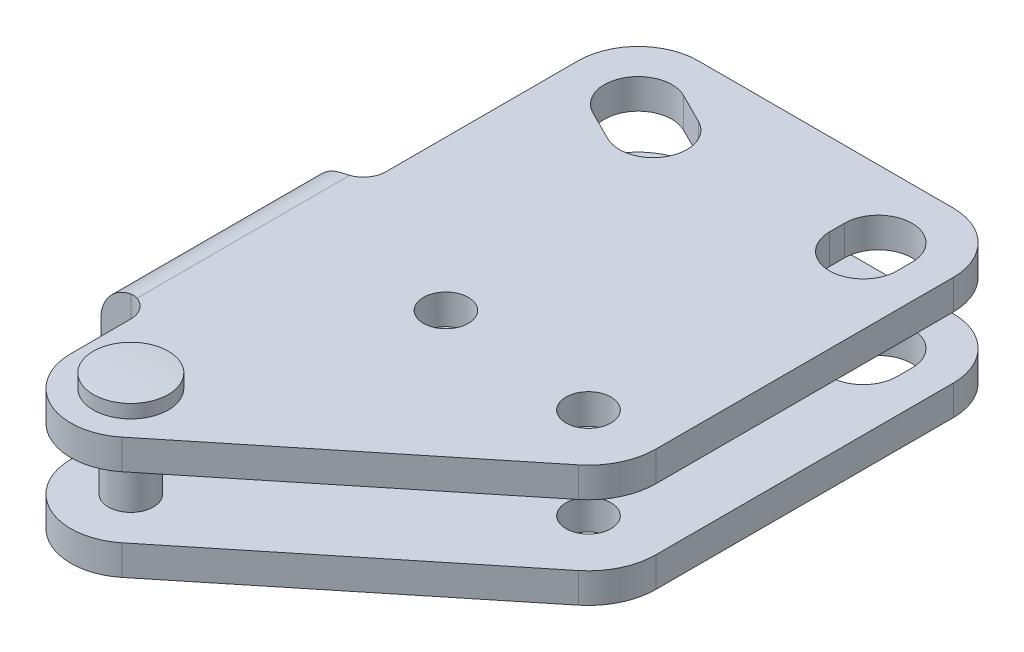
ISO-10303-21;
HEADER;
FILE_DESCRIPTION(('STEP AP214'),'2;1');
FILE_NAME('part.step','',(''),(''),'','','');
FILE_SCHEMA(('AUTOMOTIVE_DESIGN { 1 0 10303 214 1 1 1 1 }'));
ENDSEC;
DATA;
#1=APPLICATION_CONTEXT('core data for automotive mechanical design processes');
#2=APPLICATION_PROTOCOL_DEFINITION('international standard','automotive_design',2000,#1);
#3=PRODUCT_CONTEXT('',#1,'mechanical');
#4=PRODUCT('Part','Part','',(#3));
#5=PRODUCT_RELATED_PRODUCT_CATEGORY('part','',(#4));
#6=PRODUCT_DEFINITION_FORMATION('','',#4);
#7=PRODUCT_DEFINITION_CONTEXT('part definition',#1,'design');
#8=PRODUCT_DEFINITION('design','',#6,#7);
#9=PRODUCT_DEFINITION_SHAPE('','',#8);
#10=(LENGTH_UNIT() NAMED_UNIT(*) SI_UNIT(.MILLI.,.METRE.));
#11=(NAMED_UNIT(*) PLANE_ANGLE_UNIT() SI_UNIT($,.RADIAN.));
#12=(NAMED_UNIT(*) SI_UNIT($,.STERADIAN.) SOLID_ANGLE_UNIT());
#13=UNCERTAINTY_MEASURE_WITH_UNIT(LENGTH_MEASURE(1.E-05),#10,'distance_accuracy_value','');
#14=(GEOMETRIC_REPRESENTATION_CONTEXT(3) GLOBAL_UNCERTAINTY_ASSIGNED_CONTEXT((#13)) GLOBAL_UNIT_ASSIGNED_CONTEXT((#10,
#11,#12)) REPRESENTATION_CONTEXT('',''));
#15=CARTESIAN_POINT('',(0.,0.,0.));
#16=DIRECTION('',(0.,0.,1.));
#17=DIRECTION('',(1.,0.,0.));
#18=AXIS2_PLACEMENT_3D('',#15,#16,#17);
#19=CARTESIAN_POINT('',(-0.5,-3.55,33.31));
#20=DIRECTION('',(0.,-1.,0.));
#21=DIRECTION('',(1.,0.,0.));
#22=AXIS2_PLACEMENT_3D('',#19,#20,#21);
#23=CONICAL_SURFACE('',#22,0.85,1.04719755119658);
#24=CARTESIAN_POINT('',(-0.5,-3.0592522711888,33.31));
#25=VERTEX_POINT('',#24);
#26=VERTEX_LOOP('',#25);
#27=FACE_BOUND('',#26,.T.);
#28=CARTESIAN_POINT('',(-0.5,-3.55,33.31));
#29=DIRECTION('',(0.,1.,0.));
#30=DIRECTION('',(-1.,0.,0.));
#31=AXIS2_PLACEMENT_3D('',#28,#29,#30);
#32=CIRCLE('',#31,0.85);
#33=CARTESIAN_POINT('',(-1.35,-3.55,33.31));
#34=VERTEX_POINT('',#33);
#35=EDGE_CURVE('E323',#34,#34,#32,.T.);
#36=ORIENTED_EDGE('',*,*,#35,.F.);
#37=EDGE_LOOP('',(#36));
#38=FACE_BOUND('',#37,.T.);
#39=ADVANCED_FACE('F14',(#27,#38),#23,.F.);
#40=CARTESIAN_POINT('',(-0.5,-3.0592522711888,33.31));
#41=DIRECTION('',(0.,1.,0.));
#42=DIRECTION('',(-1.,0.,0.));
#43=AXIS2_PLACEMENT_3D('',#40,#41,#42);
#44=CYLINDRICAL_SURFACE('',#43,0.85000000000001);
#45=ORIENTED_EDGE('',*,*,#35,.T.);
#46=EDGE_LOOP('',(#45));
#47=FACE_BOUND('',#46,.T.);
#48=CARTESIAN_POINT('',(-0.5,-5.0379559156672,33.31));
#49=DIRECTION('',(0.,1.,0.));
#50=DIRECTION('',(-1.,0.,0.));
#51=AXIS2_PLACEMENT_3D('',#48,#49,#50);
#52=CIRCLE('',#51,0.85000000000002);
#53=CARTESIAN_POINT('',(-0.499999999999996,-5.0379559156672,34.1600000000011));
#54=VERTEX_POINT('',#53);
#55=EDGE_CURVE('E1002',#54,#54,#52,.T.);
#56=ORIENTED_EDGE('',*,*,#55,.F.);
#57=EDGE_LOOP('',(#56));
#58=FACE_BOUND('',#57,.T.);
#59=ADVANCED_FACE('F1008',(#47,#58),#44,.F.);
#60=CARTESIAN_POINT('',(-0.5,24.9499999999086,33.3100000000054));
#61=DIRECTION('',(0.,1.,0.));
#62=DIRECTION('',(0.,0.,1.));
#63=AXIS2_PLACEMENT_3D('',#60,#61,#62);
#64=SPHERICAL_SURFACE('',#63,29.9999999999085);
#65=CARTESIAN_POINT('',(-0.5,-4.9456518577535,33.31));
#66=DIRECTION('',(0.,1.,0.));
#67=DIRECTION('',(-1.,0.,0.));
#68=AXIS2_PLACEMENT_3D('',#65,#66,#67);
#69=CIRCLE('',#68,2.5);
#70=CARTESIAN_POINT('',(-0.499999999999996,-4.9456518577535,35.8100000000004));
#71=VERTEX_POINT('',#70);
#72=EDGE_CURVE('E988',#71,#71,#69,.T.);
#73=CARTESIAN_POINT('',(-0.499999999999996,-5.0379559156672,34.1600000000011));
#74=CARTESIAN_POINT('',(-0.499999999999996,-5.03746811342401,34.1772096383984));
#75=CARTESIAN_POINT('',(-0.499999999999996,-5.03696549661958,34.1944188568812));
#76=CARTESIAN_POINT('',(-0.499999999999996,-5.0359306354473,34.2288364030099));
#77=CARTESIAN_POINT('',(-0.499999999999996,-5.03539839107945,34.2460447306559));
#78=CARTESIAN_POINT('',(-0.499999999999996,-5.0343042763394,34.2804604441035));
#79=CARTESIAN_POINT('',(-0.499999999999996,-5.0337424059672,34.2976678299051));
#80=CARTESIAN_POINT('',(-0.499999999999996,-5.03258904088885,34.3320816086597));
#81=CARTESIAN_POINT('',(-0.499999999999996,-5.03199754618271,34.3492880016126));
#82=CARTESIAN_POINT('',(-0.499999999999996,-5.0307849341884,34.3836997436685));
#83=CARTESIAN_POINT('',(-0.499999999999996,-5.03016381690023,34.4009050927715));
#84=CARTESIAN_POINT('',(-0.499999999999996,-5.02889196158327,34.435314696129));
#85=CARTESIAN_POINT('',(-0.499999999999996,-5.02824122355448,34.4525189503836));
#86=CARTESIAN_POINT('',(-0.499999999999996,-5.02691012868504,34.4869263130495));
#87=CARTESIAN_POINT('',(-0.499999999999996,-5.02622977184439,34.5041294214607));
#88=CARTESIAN_POINT('',(-0.499999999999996,-5.02483944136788,34.5385344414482));
#89=CARTESIAN_POINT('',(-0.499999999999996,-5.02412946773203,34.5557363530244));
#90=CARTESIAN_POINT('',(-0.499999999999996,-5.02267990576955,34.5901389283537));
#91=CARTESIAN_POINT('',(-0.499999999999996,-5.02194031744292,34.6073395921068));
#92=CARTESIAN_POINT('',(-0.499999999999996,-5.0204315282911,34.6417396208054));
#93=CARTESIAN_POINT('',(-0.499999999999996,-5.01966232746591,34.658938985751));
#94=CARTESIAN_POINT('',(-0.499999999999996,-5.01809431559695,34.693336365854));
#95=CARTESIAN_POINT('',(-0.499999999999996,-5.01729550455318,34.7105343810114));
#96=CARTESIAN_POINT('',(-0.499999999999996,-5.01566827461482,34.7449290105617));
#97=CARTESIAN_POINT('',(-0.499999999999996,-5.01483985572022,34.7621256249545));
#98=CARTESIAN_POINT('',(-0.499999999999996,-5.01315341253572,34.796517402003));
#99=CARTESIAN_POINT('',(-0.499999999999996,-5.01229538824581,34.8137125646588));
#100=CARTESIAN_POINT('',(-0.499999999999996,-5.01054973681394,34.8481013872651));
#101=CARTESIAN_POINT('',(-0.499999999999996,-5.00966210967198,34.8652950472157));
#102=CARTESIAN_POINT('',(-0.499999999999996,-5.00785725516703,34.899680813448));
#103=CARTESIAN_POINT('',(-0.499999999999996,-5.00694002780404,34.9168729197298));
#104=CARTESIAN_POINT('',(-0.499999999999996,-5.00507597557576,34.9512555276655));
#105=CARTESIAN_POINT('',(-0.499999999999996,-5.00412915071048,34.9684460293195));
#106=CARTESIAN_POINT('',(-0.499999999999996,-5.0022059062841,35.0028253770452));
#107=CARTESIAN_POINT('',(-0.499999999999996,-5.00122948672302,35.020014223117));
#108=CARTESIAN_POINT('',(-0.499999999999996,-4.99924705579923,35.0543902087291));
#109=CARTESIAN_POINT('',(-0.499999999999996,-4.99824104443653,35.0715773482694));
#110=CARTESIAN_POINT('',(-0.499999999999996,-4.99619943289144,35.1059498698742));
#111=CARTESIAN_POINT('',(-0.499999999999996,-4.99516383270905,35.1231352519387));
#112=CARTESIAN_POINT('',(-0.499999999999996,-4.99306304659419,35.1575042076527));
#113=CARTESIAN_POINT('',(-0.499999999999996,-4.99199786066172,35.1746877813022));
#114=CARTESIAN_POINT('',(-0.499999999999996,-4.98983790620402,35.2090530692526));
#115=CARTESIAN_POINT('',(-0.499999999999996,-4.98874313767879,35.2262347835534));
#116=CARTESIAN_POINT('',(-0.499999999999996,-4.98652402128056,35.2605963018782));
#117=CARTESIAN_POINT('',(-0.499999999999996,-4.98539967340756,35.2777761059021));
#118=CARTESIAN_POINT('',(-0.499999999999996,-4.98312140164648,35.3121337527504));
#119=CARTESIAN_POINT('',(-0.499999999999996,-4.98196747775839,35.3293115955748));
#120=CARTESIAN_POINT('',(-0.499999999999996,-4.97963005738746,35.3636652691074));
#121=CARTESIAN_POINT('',(-0.499999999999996,-4.97844656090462,35.3808410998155));
#122=CARTESIAN_POINT('',(-0.499999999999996,-4.97604999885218,35.4151906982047));
#123=CARTESIAN_POINT('',(-0.499999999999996,-4.97483693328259,35.4323644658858));
#124=CARTESIAN_POINT('',(-0.499999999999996,-4.97238123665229,35.4667098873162));
#125=CARTESIAN_POINT('',(-0.499999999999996,-4.97113860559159,35.4838815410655));
#126=CARTESIAN_POINT('',(-0.499999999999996,-4.96862378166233,35.518222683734));
#127=CARTESIAN_POINT('',(-0.499999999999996,-4.96735158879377,35.5353921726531));
#128=CARTESIAN_POINT('',(-0.499999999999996,-4.9647776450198,35.5697289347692));
#129=CARTESIAN_POINT('',(-0.499999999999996,-4.96347589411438,35.5868962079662));
#130=CARTESIAN_POINT('',(-0.499999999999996,-4.96084283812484,35.6212284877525));
#131=CARTESIAN_POINT('',(-0.499999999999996,-4.95951153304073,35.6383934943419));
#132=CARTESIAN_POINT('',(-0.499999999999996,-4.95681937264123,35.6727211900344));
#133=CARTESIAN_POINT('',(-0.499999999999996,-4.95545851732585,35.6898838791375));
#134=CARTESIAN_POINT('',(-0.499999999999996,-4.95270726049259,35.7242068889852));
#135=CARTESIAN_POINT('',(-0.499999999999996,-4.9513168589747,35.7413672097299));
#136=CARTESIAN_POINT('',(-0.499999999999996,-4.94850651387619,35.7756854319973));
#137=CARTESIAN_POINT('',(-0.499999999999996,-4.94708657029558,35.7928433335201));
#138=CARTESIAN_POINT('',(-0.499999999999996,-4.9456518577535,35.8100000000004));
#139=B_SPLINE_CURVE_WITH_KNOTS('',3,(#73,#74,#75,#76,#77,#78,#79,#80,#81,#82,#83,#84,#85,#86,
#87,#88,#89,#90,#91,#92,#93,#94,#95,#96,#97,#98,#99,#100,#101,#102,#103,#104,#105,#106,#107,
#108,#109,#110,#111,#112,#113,#114,#115,#116,#117,#118,#119,#120,#121,#122,#123,#124,#125,#126,
#127,#128,#129,#130,#131,#132,#133,#134,#135,#136,#137,#138),.UNSPECIFIED.,.F.,.F.,(4,2,2,2,2,2,
2,2,2,2,2,2,2,2,2,2,2,2,2,2,2,2,2,2,2,2,2,2,2,2,2,2,4),(0.,0.0516496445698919,0.103299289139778,
0.154948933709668,0.206598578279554,0.258248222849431,0.309897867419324,0.361547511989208,
0.413197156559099,0.464846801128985,0.516496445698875,0.56814609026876,0.619795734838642,
0.671445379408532,0.723095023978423,0.774744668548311,0.826394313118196,0.878043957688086,
0.929693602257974,0.981343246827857,1.03299289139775,1.08464253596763,1.13629218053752,
1.1879418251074,1.23959146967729,1.29124111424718,1.34289075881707,1.39454040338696,
1.44619004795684,1.49783969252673,1.54948933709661,1.6011389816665,1.65278862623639),.UNSPECIFIED.);
#140=EDGE_CURVE('BSEAM1017',#54,#71,#139,.T.);
#141=ORIENTED_EDGE('',*,*,#55,.T.);
#142=ORIENTED_EDGE('',*,*,#72,.F.);
#143=ORIENTED_EDGE('',*,*,#140,.T.);
#144=ORIENTED_EDGE('',*,*,#140,.F.);
#145=EDGE_LOOP('',(#141,#143,#142,#144));
#146=FACE_BOUND('',#145,.T.);
#147=ADVANCED_FACE('F1017',(#146),#64,.T.);
#148=CARTESIAN_POINT('',(-0.5,-3.0592522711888,33.31));
#149=DIRECTION('',(0.,1.,0.));
#150=DIRECTION('',(-1.,0.,0.));
#151=AXIS2_PLACEMENT_3D('',#148,#149,#150);
#152=CYLINDRICAL_SURFACE('',#151,2.5);
#153=ORIENTED_EDGE('',*,*,#72,.T.);
#154=EDGE_LOOP('',(#153));
#155=FACE_BOUND('',#154,.T.);
#156=CARTESIAN_POINT('',(-0.5,-4.05,33.31));
#157=DIRECTION('',(0.,1.,0.));
#158=DIRECTION('',(-1.,0.,0.));
#159=AXIS2_PLACEMENT_3D('',#156,#157,#158);
#160=CIRCLE('',#159,2.5);
#161=CARTESIAN_POINT('',(-3.,-4.05,33.31));
#162=VERTEX_POINT('',#161);
#163=EDGE_CURVE('E983',#162,#162,#160,.T.);
#164=ORIENTED_EDGE('',*,*,#163,.F.);
#165=EDGE_LOOP('',(#164));
#166=FACE_BOUND('',#165,.T.);
#167=ADVANCED_FACE('F1022',(#155,#166),#152,.T.);
#168=CARTESIAN_POINT('',(-0.5,-3.0592522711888,33.31));
#169=DIRECTION('',(0.,1.,0.));
#170=DIRECTION('',(-1.,0.,0.));
#171=AXIS2_PLACEMENT_3D('',#168,#169,#170);
#172=CYLINDRICAL_SURFACE('',#171,1.5);
#173=CARTESIAN_POINT('',(-0.5,2.05,33.31));
#174=DIRECTION('',(0.,-1.,0.));
#175=DIRECTION('',(1.,0.,0.));
#176=AXIS2_PLACEMENT_3D('',#173,#174,#175);
#177=CIRCLE('',#176,1.5);
#178=CARTESIAN_POINT('',(1.,2.05,33.31));
#179=VERTEX_POINT('',#178);
#180=EDGE_CURVE('E24',#179,#179,#177,.F.);
#181=ORIENTED_EDGE('',*,*,#180,.F.);
#182=EDGE_LOOP('',(#181));
#183=FACE_BOUND('',#182,.T.);
#184=CARTESIAN_POINT('',(-0.5,-2.05,33.31));
#185=DIRECTION('',(0.,1.,0.));
#186=DIRECTION('',(-1.,0.,0.));
#187=AXIS2_PLACEMENT_3D('',#184,#185,#186);
#188=CIRCLE('',#187,1.5);
#189=CARTESIAN_POINT('',(-2.,-2.05,33.31));
#190=VERTEX_POINT('',#189);
#191=EDGE_CURVE('E9',#190,#190,#188,.T.);
#192=ORIENTED_EDGE('',*,*,#191,.T.);
#193=EDGE_LOOP('',(#192));
#194=FACE_BOUND('',#193,.T.);
#195=ADVANCED_FACE('F1026',(#183,#194),#172,.T.);
#196=CARTESIAN_POINT('',(-0.5,-24.9499999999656,33.3100000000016));
#197=DIRECTION('',(0.,1.,0.));
#198=DIRECTION('',(0.,0.,-1.));
#199=AXIS2_PLACEMENT_3D('',#196,#197,#198);
#200=SPHERICAL_SURFACE('',#199,29.9999999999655);
#201=CARTESIAN_POINT('',(-0.5,4.9456518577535,33.31));
#202=DIRECTION('',(0.,1.,0.));
#203=DIRECTION('',(-1.,0.,0.));
#204=AXIS2_PLACEMENT_3D('',#201,#202,#203);
#205=CIRCLE('',#204,2.5);
#206=CARTESIAN_POINT('',(-3.,4.9456518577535,33.31));
#207=VERTEX_POINT('',#206);
#208=EDGE_CURVE('E547',#207,#207,#205,.T.);
#209=ORIENTED_EDGE('',*,*,#208,.T.);
#210=EDGE_LOOP('',(#209));
#211=FACE_BOUND('',#210,.T.);
#212=ADVANCED_FACE('F1030',(#211),#200,.T.);
#213=CARTESIAN_POINT('',(-0.5,-3.0592522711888,33.31));
#214=DIRECTION('',(0.,1.,0.));
#215=DIRECTION('',(-1.,0.,0.));
#216=AXIS2_PLACEMENT_3D('',#213,#214,#215);
#217=CYLINDRICAL_SURFACE('',#216,2.5);
#218=CARTESIAN_POINT('',(-0.5,4.05,33.31));
#219=DIRECTION('',(0.,1.,0.));
#220=DIRECTION('',(-1.,0.,0.));
#221=AXIS2_PLACEMENT_3D('',#218,#219,#220);
#222=CIRCLE('',#221,2.5);
#223=CARTESIAN_POINT('',(-3.,4.05,33.31));
#224=VERTEX_POINT('',#223);
#225=EDGE_CURVE('E981',#224,#224,#222,.T.);
#226=ORIENTED_EDGE('',*,*,#225,.T.);
#227=EDGE_LOOP('',(#226));
#228=FACE_BOUND('',#227,.T.);
#229=ORIENTED_EDGE('',*,*,#208,.F.);
#230=EDGE_LOOP('',(#229));
#231=FACE_BOUND('',#230,.T.);
#232=ADVANCED_FACE('F1032',(#228,#231),#217,.T.);
#233=CARTESIAN_POINT('',(-6.,1.55,37.31));
#234=DIRECTION('',(1.,0.,0.));
#235=DIRECTION('',(0.,1.,0.));
#236=AXIS2_PLACEMENT_3D('',#233,#234,#235);
#237=PLANE('',#236);
#238=DIRECTION('',(0.,0.,-1.));
#239=VECTOR('',#238,1.);
#240=CARTESIAN_POINT('',(-6.,1.54999999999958,37.31));
#241=LINE('',#240,#239);
#242=CARTESIAN_POINT('',(-6.,1.54999999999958,27.81));
#243=VERTEX_POINT('',#242);
#244=CARTESIAN_POINT('',(-6.,1.54999999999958,13.81));
#245=VERTEX_POINT('',#244);
#246=EDGE_CURVE('E730',#243,#245,#241,.T.);
#247=ORIENTED_EDGE('',*,*,#246,.F.);
#248=DIRECTION('',(0.,1.,0.));
#249=VECTOR('',#248,1.);
#250=CARTESIAN_POINT('',(-6.,-4.05,27.81));
#251=LINE('',#250,#249);
#252=CARTESIAN_POINT('',(-6.,-1.55,27.81));
#253=VERTEX_POINT('',#252);
#254=EDGE_CURVE('E674',#253,#243,#251,.T.);
#255=ORIENTED_EDGE('',*,*,#254,.F.);
#256=DIRECTION('',(0.,0.,-1.));
#257=VECTOR('',#256,1.);
#258=CARTESIAN_POINT('',(-6.,-1.55,37.31));
#259=LINE('',#258,#257);
#260=CARTESIAN_POINT('',(-6.,-1.55,13.81));
#261=VERTEX_POINT('',#260);
#262=EDGE_CURVE('E722',#253,#261,#259,.T.);
#263=ORIENTED_EDGE('',*,*,#262,.T.);
#264=DIRECTION('',(0.,-1.,0.));
#265=VECTOR('',#264,1.);
#266=CARTESIAN_POINT('',(-6.,-4.05,13.81));
#267=LINE('',#266,#265);
#268=EDGE_CURVE('E518',#245,#261,#267,.T.);
#269=ORIENTED_EDGE('',*,*,#268,.F.);
#270=EDGE_LOOP('',(#247,#255,#263,#269));
#271=FACE_BOUND('',#270,.T.);
#272=ADVANCED_FACE('F526',(#271),#237,.T.);
#273=CARTESIAN_POINT('',(-6.,-4.05,13.81));
#274=DIRECTION('',(0.,0.,-1.));
#275=DIRECTION('',(0.,-1.,0.));
#276=AXIS2_PLACEMENT_3D('',#273,#274,#275);
#277=PLANE('',#276);
#278=DIRECTION('',(0.,1.,0.));
#279=VECTOR('',#278,1.);
#280=CARTESIAN_POINT('',(-6.,-4.05,13.81));
#281=LINE('',#280,#279);
#282=CARTESIAN_POINT('',(-6.,-3.99948974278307,13.81));
#283=VERTEX_POINT('',#282);
#284=EDGE_CURVE('E681',#283,#261,#281,.T.);
#285=ORIENTED_EDGE('',*,*,#284,.F.);
#286=CARTESIAN_POINT('',(-5.49999999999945,-1.54999999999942,13.81));
#287=DIRECTION('',(0.,0.,-1.));
#288=DIRECTION('',(0.,-1.,0.));
#289=AXIS2_PLACEMENT_3D('',#286,#287,#288);
#290=CIRCLE('',#289,2.50000000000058);
#291=CARTESIAN_POINT('',(-8.,-1.54999999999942,13.81));
#292=VERTEX_POINT('',#291);
#293=EDGE_CURVE('E865',#283,#292,#290,.T.);
#294=ORIENTED_EDGE('',*,*,#293,.T.);
#295=DIRECTION('',(0.,1.,0.));
#296=VECTOR('',#295,1.);
#297=CARTESIAN_POINT('',(-8.,-4.05,13.81));
#298=LINE('',#297,#296);
#299=CARTESIAN_POINT('',(-8.,1.55,13.81));
#300=VERTEX_POINT('',#299);
#301=EDGE_CURVE('E677',#292,#300,#298,.T.);
#302=ORIENTED_EDGE('',*,*,#301,.T.);
#303=CARTESIAN_POINT('',(-5.49999999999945,1.54999999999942,13.81));
#304=DIRECTION('',(0.,0.,-1.));
#305=DIRECTION('',(0.,-1.,0.));
#306=AXIS2_PLACEMENT_3D('',#303,#304,#305);
#307=CIRCLE('',#306,2.50000000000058);
#308=CARTESIAN_POINT('',(-6.,3.99948974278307,13.81));
#309=VERTEX_POINT('',#308);
#310=EDGE_CURVE('E452',#300,#309,#307,.T.);
#311=ORIENTED_EDGE('',*,*,#310,.T.);
#312=EDGE_CURVE('E680',#245,#309,#281,.T.);
#313=ORIENTED_EDGE('',*,*,#312,.F.);
#314=ORIENTED_EDGE('',*,*,#268,.T.);
#315=EDGE_LOOP('',(#285,#294,#302,#311,#313,#314));
#316=FACE_BOUND('',#315,.T.);
#317=ADVANCED_FACE('F492',(#316),#277,.T.);
#318=CARTESIAN_POINT('',(-8.,-4.05,13.81));
#319=DIRECTION('',(-1.,0.,0.));
#320=DIRECTION('',(0.,-1.,0.));
#321=AXIS2_PLACEMENT_3D('',#318,#319,#320);
#322=PLANE('',#321);
#323=DIRECTION('',(0.,0.,-1.));
#324=VECTOR('',#323,1.);
#325=CARTESIAN_POINT('',(-8.,-1.54999999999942,37.31));
#326=LINE('',#325,#324);
#327=CARTESIAN_POINT('',(-8.,-1.54999999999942,27.81));
#328=VERTEX_POINT('',#327);
#329=EDGE_CURVE('E435',#328,#292,#326,.T.);
#330=ORIENTED_EDGE('',*,*,#329,.F.);
#331=DIRECTION('',(0.,1.,0.));
#332=VECTOR('',#331,1.);
#333=CARTESIAN_POINT('',(-8.,-4.05,27.81));
#334=LINE('',#333,#332);
#335=CARTESIAN_POINT('',(-8.,1.55,27.81));
#336=VERTEX_POINT('',#335);
#337=EDGE_CURVE('E673',#328,#336,#334,.T.);
#338=ORIENTED_EDGE('',*,*,#337,.T.);
#339=DIRECTION('',(0.,0.,-1.));
#340=VECTOR('',#339,1.);
#341=CARTESIAN_POINT('',(-8.,1.55,37.31));
#342=LINE('',#341,#340);
#343=EDGE_CURVE('E432',#336,#300,#342,.T.);
#344=ORIENTED_EDGE('',*,*,#343,.T.);
#345=ORIENTED_EDGE('',*,*,#301,.F.);
#346=EDGE_LOOP('',(#330,#338,#344,#345));
#347=FACE_BOUND('',#346,.T.);
#348=ADVANCED_FACE('F1065',(#347),#322,.T.);
#349=CARTESIAN_POINT('',(-8.,-4.05,27.81));
#350=DIRECTION('',(0.,0.,1.));
#351=DIRECTION('',(0.,1.,0.));
#352=AXIS2_PLACEMENT_3D('',#349,#350,#351);
#353=PLANE('',#352);
#354=ORIENTED_EDGE('',*,*,#337,.F.);
#355=CARTESIAN_POINT('',(-5.49999999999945,-1.54999999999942,27.81));
#356=DIRECTION('',(0.,0.,1.));
#357=DIRECTION('',(0.,1.,0.));
#358=AXIS2_PLACEMENT_3D('',#355,#356,#357);
#359=CIRCLE('',#358,2.50000000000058);
#360=CARTESIAN_POINT('',(-6.,-3.99948974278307,27.81));
#361=VERTEX_POINT('',#360);
#362=EDGE_CURVE('E481',#328,#361,#359,.T.);
#363=ORIENTED_EDGE('',*,*,#362,.T.);
#364=EDGE_CURVE('E671',#361,#253,#251,.T.);
#365=ORIENTED_EDGE('',*,*,#364,.T.);
#366=ORIENTED_EDGE('',*,*,#254,.T.);
#367=CARTESIAN_POINT('',(-6.,3.99948974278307,27.81));
#368=VERTEX_POINT('',#367);
#369=EDGE_CURVE('E670',#243,#368,#251,.T.);
#370=ORIENTED_EDGE('',*,*,#369,.T.);
#371=CARTESIAN_POINT('',(-5.49999999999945,1.54999999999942,27.81));
#372=DIRECTION('',(0.,0.,1.));
#373=DIRECTION('',(0.,1.,0.));
#374=AXIS2_PLACEMENT_3D('',#371,#372,#373);
#375=CIRCLE('',#374,2.50000000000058);
#376=EDGE_CURVE('E440',#368,#336,#375,.T.);
#377=ORIENTED_EDGE('',*,*,#376,.T.);
#378=EDGE_LOOP('',(#354,#363,#365,#366,#370,#377));
#379=FACE_BOUND('',#378,.T.);
#380=ADVANCED_FACE('F1072',(#379),#353,.T.);
#381=CARTESIAN_POINT('',(-5.4999999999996,-1.54999999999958,37.31));
#382=DIRECTION('',(0.,0.,-1.));
#383=DIRECTION('',(0.,-1.,0.));
#384=AXIS2_PLACEMENT_3D('',#381,#382,#383);
#385=CYLINDRICAL_SURFACE('',#384,0.50000000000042);
#386=ORIENTED_EDGE('',*,*,#262,.F.);
#387=CARTESIAN_POINT('',(-5.5,-2.05,27.8957864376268));
#388=CARTESIAN_POINT('',(-5.52636578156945,-2.05003149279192,27.8864335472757));
#389=CARTESIAN_POINT('',(-5.55303347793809,-2.04791473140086,27.8778653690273));
#390=CARTESIAN_POINT('',(-5.60614678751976,-2.03933480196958,27.8623738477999));
#391=CARTESIAN_POINT('',(-5.63259237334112,-2.03287110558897,27.8554507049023));
#392=CARTESIAN_POINT('',(-5.6844846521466,-2.0155286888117,27.8433138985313));
#393=CARTESIAN_POINT('',(-5.70992906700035,-2.00464047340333,27.8381039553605));
#394=CARTESIAN_POINT('',(-5.75885835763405,-1.97867054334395,27.8293017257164));
#395=CARTESIAN_POINT('',(-5.78234470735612,-1.96359202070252,27.8257082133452));
#396=CARTESIAN_POINT('',(-5.82595975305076,-1.93011212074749,27.8199725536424));
#397=CARTESIAN_POINT('',(-5.84616384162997,-1.91181518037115,27.8177927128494));
#398=CARTESIAN_POINT('',(-5.88337322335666,-1.8721260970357,27.8144238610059));
#399=CARTESIAN_POINT('',(-5.90037721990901,-1.85073270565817,27.8132352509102));
#400=CARTESIAN_POINT('',(-5.93084480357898,-1.80520797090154,27.811516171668));
#401=CARTESIAN_POINT('',(-5.94426904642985,-1.78105006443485,27.8109927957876));
#402=CARTESIAN_POINT('',(-5.96695818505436,-1.73085396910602,27.8103209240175));
#403=CARTESIAN_POINT('',(-5.97622440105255,-1.70481638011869,27.8101723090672));
#404=CARTESIAN_POINT('',(-5.98882847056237,-1.65730531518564,27.8100309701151));
#405=CARTESIAN_POINT('',(-5.99301190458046,-1.63605180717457,27.8100116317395));
#406=CARTESIAN_POINT('',(-5.9985997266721,-1.59320131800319,27.810000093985));
#407=CARTESIAN_POINT('',(-6.00000649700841,-1.57160464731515,27.810007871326));
#408=CARTESIAN_POINT('',(-6.,-1.55,27.81));
#409=B_SPLINE_CURVE_WITH_KNOTS('',3,(#387,#388,#389,#390,#391,#392,#393,#394,#395,#396,#397,
#398,#399,#400,#401,#402,#403,#404,#405,#406,#407,#408),.UNSPECIFIED.,.F.,.F.,(4,2,2,2,2,2,2,2,
2,2,4),(0.,0.0838673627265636,0.167744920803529,0.251803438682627,0.335798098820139,
0.417449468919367,0.499133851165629,0.581682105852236,0.664204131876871,0.729013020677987,
0.793766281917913),.UNSPECIFIED.);
#410=CARTESIAN_POINT('',(-5.5,-2.05,27.8957864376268));
#411=VERTEX_POINT('',#410);
#412=EDGE_CURVE('E538',#411,#253,#409,.T.);
#413=ORIENTED_EDGE('',*,*,#412,.F.);
#414=DIRECTION('',(0.,0.,-1.));
#415=VECTOR('',#414,1.);
#416=CARTESIAN_POINT('',(-5.5,-2.05,37.31));
#417=LINE('',#416,#415);
#418=CARTESIAN_POINT('',(-5.5,-2.05,13.7242135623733));
#419=VERTEX_POINT('',#418);
#420=EDGE_CURVE('E719',#411,#419,#417,.T.);
#421=ORIENTED_EDGE('',*,*,#420,.T.);
#422=CARTESIAN_POINT('',(-6.,-1.55,13.81));
#423=CARTESIAN_POINT('',(-6.00002385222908,-1.57809805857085,13.8099775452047));
#424=CARTESIAN_POINT('',(-5.99763291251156,-1.60618931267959,13.8099996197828));
#425=CARTESIAN_POINT('',(-5.98819630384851,-1.66156277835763,13.8099669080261));
#426=CARTESIAN_POINT('',(-5.98115336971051,-1.68884545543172,13.8099121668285));
#427=CARTESIAN_POINT('',(-5.9625822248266,-1.74185551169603,13.8095601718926));
#428=CARTESIAN_POINT('',(-5.95105158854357,-1.76758204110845,13.8092627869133));
#429=CARTESIAN_POINT('',(-5.92384639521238,-1.81672521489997,13.8081276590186));
#430=CARTESIAN_POINT('',(-5.90817251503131,-1.8401422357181,13.8072900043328));
#431=CARTESIAN_POINT('',(-5.87322743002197,-1.88388832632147,13.8047350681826));
#432=CARTESIAN_POINT('',(-5.85397317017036,-1.90423115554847,13.8030218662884));
#433=CARTESIAN_POINT('',(-5.81242841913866,-1.94136184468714,13.7983724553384));
#434=CARTESIAN_POINT('',(-5.79013871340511,-1.9581506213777,13.7954365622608));
#435=CARTESIAN_POINT('',(-5.74370775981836,-1.98743095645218,13.7881256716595));
#436=CARTESIAN_POINT('',(-5.71960930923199,-1.99999751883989,13.7837788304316));
#437=CARTESIAN_POINT('',(-5.66998713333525,-2.02098815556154,13.7734660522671));
#438=CARTESIAN_POINT('',(-5.64446318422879,-2.02941157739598,13.7674998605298));
#439=CARTESIAN_POINT('',(-5.59897908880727,-2.04052416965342,13.7555434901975));
#440=CARTESIAN_POINT('',(-5.57913833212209,-2.04410037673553,13.7498960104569));
#441=CARTESIAN_POINT('',(-5.53948085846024,-2.04883944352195,13.7377106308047));
#442=CARTESIAN_POINT('',(-5.5196641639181,-2.0500067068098,13.7311743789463));
#443=CARTESIAN_POINT('',(-5.5,-2.05,13.7242135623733));
#444=B_SPLINE_CURVE_WITH_KNOTS('',3,(#422,#423,#424,#425,#426,#427,#428,#429,#430,#431,#432,
#433,#434,#435,#436,#437,#438,#439,#440,#441,#442,#443),.UNSPECIFIED.,.F.,.F.,(4,2,2,2,2,2,2,2,
2,2,4),(0.,0.0841830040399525,0.168316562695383,0.252495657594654,0.336661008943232,
0.420437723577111,0.504192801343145,0.586369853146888,0.668559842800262,0.731216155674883,
0.793757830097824),.UNSPECIFIED.);
#445=EDGE_CURVE('E499',#261,#419,#444,.T.);
#446=ORIENTED_EDGE('',*,*,#445,.F.);
#447=EDGE_LOOP('',(#386,#413,#421,#446));
#448=FACE_BOUND('',#447,.T.);
#449=ADVANCED_FACE('F466',(#448),#385,.F.);
#450=CARTESIAN_POINT('',(-4.5,-4.05,-0.49999999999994));
#451=DIRECTION('',(-1.,0.,0.));
#452=DIRECTION('',(0.,-1.,0.));
#453=AXIS2_PLACEMENT_3D('',#450,#451,#452);
#454=PLANE('',#453);
#455=DIRECTION('',(0.,1.,0.));
#456=VECTOR('',#455,1.);
#457=CARTESIAN_POINT('',(-4.5,-4.05,12.31));
#458=LINE('',#457,#456);
#459=CARTESIAN_POINT('',(-4.5,-4.05,12.31));
#460=VERTEX_POINT('',#459);
#461=CARTESIAN_POINT('',(-4.5,-2.05,12.31));
#462=VERTEX_POINT('',#461);
#463=EDGE_CURVE('E684',#460,#462,#458,.T.);
#464=ORIENTED_EDGE('',*,*,#463,.T.);
#465=DIRECTION('',(0.,0.,-1.));
#466=VECTOR('',#465,1.);
#467=CARTESIAN_POINT('',(-4.5,-2.05,-0.49999999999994));
#468=LINE('',#467,#466);
#469=CARTESIAN_POINT('',(-4.5,-2.05,-0.499999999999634));
#470=VERTEX_POINT('',#469);
#471=EDGE_CURVE('E784',#462,#470,#468,.T.);
#472=ORIENTED_EDGE('',*,*,#471,.T.);
#473=DIRECTION('',(0.,1.,0.));
#474=VECTOR('',#473,1.);
#475=CARTESIAN_POINT('',(-4.5,-4.05,-0.499999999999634));
#476=LINE('',#475,#474);
#477=CARTESIAN_POINT('',(-4.5,-4.05,-0.499999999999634));
#478=VERTEX_POINT('',#477);
#479=EDGE_CURVE('E688',#478,#470,#476,.T.);
#480=ORIENTED_EDGE('',*,*,#479,.F.);
#481=DIRECTION('',(0.,0.,1.));
#482=VECTOR('',#481,1.);
#483=CARTESIAN_POINT('',(-4.5,-4.05,-0.49999999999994));
#484=LINE('',#483,#482);
#485=EDGE_CURVE('E621',#478,#460,#484,.T.);
#486=ORIENTED_EDGE('',*,*,#485,.T.);
#487=EDGE_LOOP('',(#464,#472,#480,#486));
#488=FACE_BOUND('',#487,.T.);
#489=ADVANCED_FACE('F494',(#488),#454,.T.);
#490=CARTESIAN_POINT('',(-5.9999999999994,-4.05,12.3100000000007));
#491=DIRECTION('',(0.,1.,0.));
#492=DIRECTION('',(-1.,0.,0.));
#493=AXIS2_PLACEMENT_3D('',#490,#491,#492);
#494=CYLINDRICAL_SURFACE('',#493,1.49999999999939);
#495=CARTESIAN_POINT('',(-5.9999999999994,-4.05,12.3100000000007));
#496=DIRECTION('',(0.,-1.,0.));
#497=DIRECTION('',(-1.,0.,0.));
#498=AXIS2_PLACEMENT_3D('',#495,#496,#497);
#499=CIRCLE('',#498,1.49999999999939);
#500=CARTESIAN_POINT('',(-5.49999999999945,-4.05,13.7242135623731));
#501=VERTEX_POINT('',#500);
#502=EDGE_CURVE('E625',#460,#501,#499,.T.);
#503=ORIENTED_EDGE('',*,*,#502,.T.);
#504=CARTESIAN_POINT('',(-5.5,-4.05,13.7242135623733));
#505=CARTESIAN_POINT('',(-5.54050527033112,-4.05001066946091,13.7385459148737));
#506=CARTESIAN_POINT('',(-5.58163649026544,-4.04901554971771,13.751118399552));
#507=CARTESIAN_POINT('',(-5.66432424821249,-4.04493115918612,13.7725732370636));
#508=CARTESIAN_POINT('',(-5.70587287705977,-4.04186214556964,13.7814899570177));
#509=CARTESIAN_POINT('',(-5.78936534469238,-4.03355131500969,13.7957411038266));
#510=CARTESIAN_POINT('',(-5.83130918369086,-4.02830949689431,13.8010755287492));
#511=CARTESIAN_POINT('',(-5.91557877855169,-4.01559167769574,13.8082278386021));
#512=CARTESIAN_POINT('',(-5.95790428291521,-4.00809445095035,13.8100110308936));
#513=CARTESIAN_POINT('',(-6.,-3.99948974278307,13.81));
#514=B_SPLINE_CURVE_WITH_KNOTS('',3,(#504,#505,#506,#507,#508,#509,#510,#511,#512,#513),
.UNSPECIFIED.,.F.,.F.,(4,2,2,2,4),(0.,0.128851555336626,0.256462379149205,0.384073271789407,
0.512924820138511),.UNSPECIFIED.);
#515=EDGE_CURVE('E866',#501,#283,#514,.T.);
#516=ORIENTED_EDGE('',*,*,#515,.T.);
#517=ORIENTED_EDGE('',*,*,#284,.T.);
#518=ORIENTED_EDGE('',*,*,#445,.T.);
#519=CARTESIAN_POINT('',(-5.9999999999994,-2.05,12.3100000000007));
#520=DIRECTION('',(0.,1.,0.));
#521=DIRECTION('',(-1.,0.,0.));
#522=AXIS2_PLACEMENT_3D('',#519,#520,#521);
#523=CIRCLE('',#522,1.49999999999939);
#524=EDGE_CURVE('E727',#419,#462,#523,.T.);
#525=ORIENTED_EDGE('',*,*,#524,.T.);
#526=ORIENTED_EDGE('',*,*,#463,.F.);
#527=EDGE_LOOP('',(#503,#516,#517,#518,#525,#526));
#528=FACE_BOUND('',#527,.T.);
#529=ADVANCED_FACE('F491',(#528),#494,.F.);
#530=CARTESIAN_POINT('',(-5.49999999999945,-1.54999999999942,37.31));
#531=DIRECTION('',(0.,0.,-1.));
#532=DIRECTION('',(0.,-1.,0.));
#533=AXIS2_PLACEMENT_3D('',#530,#531,#532);
#534=CYLINDRICAL_SURFACE('',#533,2.50000000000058);
#535=DIRECTION('',(0.,0.,-1.));
#536=VECTOR('',#535,1.);
#537=CARTESIAN_POINT('',(-5.5,-4.05,37.31));
#538=LINE('',#537,#536);
#539=CARTESIAN_POINT('',(-5.5,-4.05,27.895786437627));
#540=VERTEX_POINT('',#539);
#541=EDGE_CURVE('E437',#540,#501,#538,.T.);
#542=ORIENTED_EDGE('',*,*,#541,.F.);
#543=CARTESIAN_POINT('',(-6.,-3.99948974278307,27.81));
#544=CARTESIAN_POINT('',(-5.95790428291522,-4.00809445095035,27.8099889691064));
#545=CARTESIAN_POINT('',(-5.9155787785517,-4.01559167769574,27.811772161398));
#546=CARTESIAN_POINT('',(-5.83130918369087,-4.02830949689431,27.8189244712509));
#547=CARTESIAN_POINT('',(-5.78936534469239,-4.03355131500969,27.8242588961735));
#548=CARTESIAN_POINT('',(-5.70587287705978,-4.04186214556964,27.8385100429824));
#549=CARTESIAN_POINT('',(-5.6643242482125,-4.04493115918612,27.8474267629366));
#550=CARTESIAN_POINT('',(-5.58163649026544,-4.04901554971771,27.8688816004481));
#551=CARTESIAN_POINT('',(-5.54050527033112,-4.05001066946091,27.8814540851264));
#552=CARTESIAN_POINT('',(-5.5,-4.05,27.8957864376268));
#553=B_SPLINE_CURVE_WITH_KNOTS('',3,(#543,#544,#545,#546,#547,#548,#549,#550,#551,#552),
.UNSPECIFIED.,.F.,.F.,(4,2,2,2,4),(0.,0.128851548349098,0.256462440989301,0.384073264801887,
0.512924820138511),.UNSPECIFIED.);
#554=EDGE_CURVE('E862',#361,#540,#553,.T.);
#555=ORIENTED_EDGE('',*,*,#554,.F.);
#556=ORIENTED_EDGE('',*,*,#362,.F.);
#557=ORIENTED_EDGE('',*,*,#329,.T.);
#558=ORIENTED_EDGE('',*,*,#293,.F.);
#559=ORIENTED_EDGE('',*,*,#515,.F.);
#560=EDGE_LOOP('',(#542,#555,#556,#557,#558,#559));
#561=FACE_BOUND('',#560,.T.);
#562=ADVANCED_FACE('F467',(#561),#534,.T.);
#563=CARTESIAN_POINT('',(-5.9999999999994,-4.05,29.3099999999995));
#564=DIRECTION('',(0.,1.,0.));
#565=DIRECTION('',(-1.,0.,0.));
#566=AXIS2_PLACEMENT_3D('',#563,#564,#565);
#567=CYLINDRICAL_SURFACE('',#566,1.49999999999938);
#568=ORIENTED_EDGE('',*,*,#364,.F.);
#569=ORIENTED_EDGE('',*,*,#554,.T.);
#570=CARTESIAN_POINT('',(-5.9999999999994,-4.05,29.3099999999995));
#571=DIRECTION('',(0.,-1.,0.));
#572=DIRECTION('',(-1.,0.,0.));
#573=AXIS2_PLACEMENT_3D('',#570,#571,#572);
#574=CIRCLE('',#573,1.49999999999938);
#575=CARTESIAN_POINT('',(-4.5,-4.05,29.31));
#576=VERTEX_POINT('',#575);
#577=EDGE_CURVE('E633',#540,#576,#574,.T.);
#578=ORIENTED_EDGE('',*,*,#577,.T.);
#579=DIRECTION('',(0.,1.,0.));
#580=VECTOR('',#579,1.);
#581=CARTESIAN_POINT('',(-4.5,-4.05,29.31));
#582=LINE('',#581,#580);
#583=CARTESIAN_POINT('',(-4.5,-2.05,29.31));
#584=VERTEX_POINT('',#583);
#585=EDGE_CURVE('E667',#576,#584,#582,.T.);
#586=ORIENTED_EDGE('',*,*,#585,.T.);
#587=CARTESIAN_POINT('',(-5.9999999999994,-2.05,29.3099999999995));
#588=DIRECTION('',(0.,1.,0.));
#589=DIRECTION('',(-1.,0.,0.));
#590=AXIS2_PLACEMENT_3D('',#587,#588,#589);
#591=CIRCLE('',#590,1.49999999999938);
#592=EDGE_CURVE('E713',#584,#411,#591,.T.);
#593=ORIENTED_EDGE('',*,*,#592,.T.);
#594=ORIENTED_EDGE('',*,*,#412,.T.);
#595=EDGE_LOOP('',(#568,#569,#578,#586,#593,#594));
#596=FACE_BOUND('',#595,.T.);
#597=ADVANCED_FACE('F711',(#596),#567,.F.);
#598=CARTESIAN_POINT('',(-4.5,-4.05,29.31));
#599=DIRECTION('',(-1.,0.,0.));
#600=DIRECTION('',(0.,-1.,0.));
#601=AXIS2_PLACEMENT_3D('',#598,#599,#600);
#602=PLANE('',#601);
#603=DIRECTION('',(0.,1.,0.));
#604=VECTOR('',#603,1.);
#605=CARTESIAN_POINT('',(-4.5,-4.05,33.31));
#606=LINE('',#605,#604);
#607=CARTESIAN_POINT('',(-4.5,-4.05,33.31));
#608=VERTEX_POINT('',#607);
#609=CARTESIAN_POINT('',(-4.5,-2.05,33.31));
#610=VERTEX_POINT('',#609);
#611=EDGE_CURVE('E663',#608,#610,#606,.T.);
#612=ORIENTED_EDGE('',*,*,#611,.T.);
#613=DIRECTION('',(0.,0.,-1.));
#614=VECTOR('',#613,1.);
#615=CARTESIAN_POINT('',(-4.5,-2.05,29.31));
#616=LINE('',#615,#614);
#617=EDGE_CURVE('E774',#610,#584,#616,.T.);
#618=ORIENTED_EDGE('',*,*,#617,.T.);
#619=ORIENTED_EDGE('',*,*,#585,.F.);
#620=DIRECTION('',(0.,0.,1.));
#621=VECTOR('',#620,1.);
#622=CARTESIAN_POINT('',(-4.5,-4.05,29.31));
#623=LINE('',#622,#621);
#624=EDGE_CURVE('E635',#576,#608,#623,.T.);
#625=ORIENTED_EDGE('',*,*,#624,.T.);
#626=EDGE_LOOP('',(#612,#618,#619,#625));
#627=FACE_BOUND('',#626,.T.);
#628=ADVANCED_FACE('F860',(#627),#602,.T.);
#629=CARTESIAN_POINT('',(-0.500000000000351,-4.05,33.31));
#630=DIRECTION('',(0.,1.,0.));
#631=DIRECTION('',(-1.,0.,0.));
#632=AXIS2_PLACEMENT_3D('',#629,#630,#631);
#633=CYLINDRICAL_SURFACE('',#632,3.99999999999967);
#634=CARTESIAN_POINT('',(-0.500000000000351,-2.05,33.31));
#635=DIRECTION('',(0.,1.,0.));
#636=DIRECTION('',(-1.,0.,0.));
#637=AXIS2_PLACEMENT_3D('',#634,#635,#636);
#638=CIRCLE('',#637,3.99999999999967);
#639=CARTESIAN_POINT('',(2.016743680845,-2.05,36.4190193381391));
#640=VERTEX_POINT('',#639);
#641=EDGE_CURVE('E772',#640,#610,#638,.F.);
#642=ORIENTED_EDGE('',*,*,#641,.T.);
#643=ORIENTED_EDGE('',*,*,#611,.F.);
#644=CARTESIAN_POINT('',(-0.500000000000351,-4.05,33.31));
#645=DIRECTION('',(0.,1.,0.));
#646=DIRECTION('',(-1.,0.,0.));
#647=AXIS2_PLACEMENT_3D('',#644,#645,#646);
#648=CIRCLE('',#647,3.99999999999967);
#649=CARTESIAN_POINT('',(2.016743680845,-4.05,36.4190193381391));
#650=VERTEX_POINT('',#649);
#651=EDGE_CURVE('E638',#608,#650,#648,.T.);
#652=ORIENTED_EDGE('',*,*,#651,.T.);
#653=DIRECTION('',(0.,1.,0.));
#654=VECTOR('',#653,1.);
#655=CARTESIAN_POINT('',(2.016743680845,-4.05,36.4190193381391));
#656=LINE('',#655,#654);
#657=EDGE_CURVE('E659',#650,#640,#656,.T.);
#658=ORIENTED_EDGE('',*,*,#657,.T.);
#659=EDGE_LOOP('',(#642,#643,#652,#658));
#660=FACE_BOUND('',#659,.T.);
#661=ADVANCED_FACE('F857',(#660),#633,.T.);
#662=CARTESIAN_POINT('',(2.016743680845,-4.05,36.4190193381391));
#663=DIRECTION('',(0.629185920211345,0.,0.777254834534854));
#664=DIRECTION('',(0.777254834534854,0.,-0.629185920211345));
#665=AXIS2_PLACEMENT_3D('',#662,#663,#664);
#666=PLANE('',#665);
#667=DIRECTION('',(0.,1.,0.));
#668=VECTOR('',#667,1.);
#669=CARTESIAN_POINT('',(18.8313366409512,-4.05,22.807646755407));
#670=LINE('',#669,#668);
#671=CARTESIAN_POINT('',(18.8313366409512,-4.05,22.807646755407));
#672=VERTEX_POINT('',#671);
#673=CARTESIAN_POINT('',(18.8313366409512,-2.05,22.807646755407));
#674=VERTEX_POINT('',#673);
#675=EDGE_CURVE('E655',#672,#674,#670,.T.);
#676=ORIENTED_EDGE('',*,*,#675,.T.);
#677=DIRECTION('',(-0.777254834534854,0.,0.629185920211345));
#678=VECTOR('',#677,1.);
#679=CARTESIAN_POINT('',(2.016743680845,-2.05,36.4190193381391));
#680=LINE('',#679,#678);
#681=EDGE_CURVE('E769',#674,#640,#680,.T.);
#682=ORIENTED_EDGE('',*,*,#681,.T.);
#683=ORIENTED_EDGE('',*,*,#657,.F.);
#684=DIRECTION('',(0.777254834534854,0.,-0.629185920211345));
#685=VECTOR('',#684,1.);
#686=CARTESIAN_POINT('',(2.016743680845,-4.05,36.4190193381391));
#687=LINE('',#686,#685);
#688=EDGE_CURVE('E640',#650,#672,#687,.T.);
#689=ORIENTED_EDGE('',*,*,#688,.T.);
#690=EDGE_LOOP('',(#676,#682,#683,#689));
#691=FACE_BOUND('',#690,.T.);
#692=ADVANCED_FACE('F855',(#691),#666,.T.);
#693=CARTESIAN_POINT('',(16.,-4.05,19.3100000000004));
#694=DIRECTION('',(0.,1.,0.));
#695=DIRECTION('',(-1.,0.,0.));
#696=AXIS2_PLACEMENT_3D('',#693,#694,#695);
#697=CYLINDRICAL_SURFACE('',#696,4.4999999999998);
#698=DIRECTION('',(0.,1.,0.));
#699=VECTOR('',#698,1.);
#700=CARTESIAN_POINT('',(20.5,-4.05,19.31));
#701=LINE('',#700,#699);
#702=CARTESIAN_POINT('',(20.5,-4.05,19.31));
#703=VERTEX_POINT('',#702);
#704=CARTESIAN_POINT('',(20.5,-2.05,19.31));
#705=VERTEX_POINT('',#704);
#706=EDGE_CURVE('E651',#703,#705,#701,.T.);
#707=ORIENTED_EDGE('',*,*,#706,.T.);
#708=CARTESIAN_POINT('',(16.,-2.05,19.3100000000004));
#709=DIRECTION('',(0.,1.,0.));
#710=DIRECTION('',(-1.,0.,0.));
#711=AXIS2_PLACEMENT_3D('',#708,#709,#710);
#712=CIRCLE('',#711,4.4999999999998);
#713=EDGE_CURVE('E704',#705,#674,#712,.F.);
#714=ORIENTED_EDGE('',*,*,#713,.T.);
#715=ORIENTED_EDGE('',*,*,#675,.F.);
#716=CARTESIAN_POINT('',(16.,-4.05,19.3100000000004));
#717=DIRECTION('',(0.,1.,0.));
#718=DIRECTION('',(-1.,0.,0.));
#719=AXIS2_PLACEMENT_3D('',#716,#717,#718);
#720=CIRCLE('',#719,4.4999999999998);
#721=EDGE_CURVE('E643',#672,#703,#720,.T.);
#722=ORIENTED_EDGE('',*,*,#721,.T.);
#723=EDGE_LOOP('',(#707,#714,#715,#722));
#724=FACE_BOUND('',#723,.T.);
#725=ADVANCED_FACE('F849',(#724),#697,.T.);
#726=CARTESIAN_POINT('',(20.5,-4.05,19.31));
#727=DIRECTION('',(1.,0.,0.));
#728=DIRECTION('',(0.,1.,0.));
#729=AXIS2_PLACEMENT_3D('',#726,#727,#728);
#730=PLANE('',#729);
#731=DIRECTION('',(0.,1.,0.));
#732=VECTOR('',#731,1.);
#733=CARTESIAN_POINT('',(20.5,-4.05,-0.49999999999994));
#734=LINE('',#733,#732);
#735=CARTESIAN_POINT('',(20.5,-4.05,-0.49999999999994));
#736=VERTEX_POINT('',#735);
#737=CARTESIAN_POINT('',(20.5,-2.05,-0.49999999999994));
#738=VERTEX_POINT('',#737);
#739=EDGE_CURVE('E699',#736,#738,#734,.T.);
#740=ORIENTED_EDGE('',*,*,#739,.T.);
#741=DIRECTION('',(0.,0.,1.));
#742=VECTOR('',#741,1.);
#743=CARTESIAN_POINT('',(20.5,-2.05,19.31));
#744=LINE('',#743,#742);
#745=EDGE_CURVE('E777',#738,#705,#744,.T.);
#746=ORIENTED_EDGE('',*,*,#745,.T.);
#747=ORIENTED_EDGE('',*,*,#706,.F.);
#748=DIRECTION('',(0.,0.,-1.));
#749=VECTOR('',#748,1.);
#750=CARTESIAN_POINT('',(20.5,-4.05,19.31));
#751=LINE('',#750,#749);
#752=EDGE_CURVE('E647',#703,#736,#751,.T.);
#753=ORIENTED_EDGE('',*,*,#752,.T.);
#754=EDGE_LOOP('',(#740,#746,#747,#753));
#755=FACE_BOUND('',#754,.T.);
#756=ADVANCED_FACE('F16',(#755),#730,.T.);
#757=CARTESIAN_POINT('',(16.5,-4.05,-0.49999999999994));
#758=DIRECTION('',(0.,1.,0.));
#759=DIRECTION('',(-1.,0.,0.));
#760=AXIS2_PLACEMENT_3D('',#757,#758,#759);
#761=CYLINDRICAL_SURFACE('',#760,4.);
#762=DIRECTION('',(0.,1.,0.));
#763=VECTOR('',#762,1.);
#764=CARTESIAN_POINT('',(16.5,-4.05,-4.49999999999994));
#765=LINE('',#764,#763);
#766=CARTESIAN_POINT('',(16.5,-4.05,-4.49999999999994));
#767=VERTEX_POINT('',#766);
#768=CARTESIAN_POINT('',(16.5,-2.05,-4.49999999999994));
#769=VERTEX_POINT('',#768);
#770=EDGE_CURVE('E695',#767,#769,#765,.T.);
#771=ORIENTED_EDGE('',*,*,#770,.T.);
#772=CARTESIAN_POINT('',(16.5,-2.05,-0.49999999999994));
#773=DIRECTION('',(0.,1.,0.));
#774=DIRECTION('',(-1.,0.,0.));
#775=AXIS2_PLACEMENT_3D('',#772,#773,#774);
#776=CIRCLE('',#775,4.);
#777=EDGE_CURVE('E780',#769,#738,#776,.F.);
#778=ORIENTED_EDGE('',*,*,#777,.T.);
#779=ORIENTED_EDGE('',*,*,#739,.F.);
#780=CARTESIAN_POINT('',(16.5,-4.05,-0.49999999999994));
#781=DIRECTION('',(0.,1.,0.));
#782=DIRECTION('',(-1.,0.,0.));
#783=AXIS2_PLACEMENT_3D('',#780,#781,#782);
#784=CIRCLE('',#783,4.);
#785=EDGE_CURVE('E627',#736,#767,#784,.T.);
#786=ORIENTED_EDGE('',*,*,#785,.T.);
#787=EDGE_LOOP('',(#771,#778,#779,#786));
#788=FACE_BOUND('',#787,.T.);
#789=ADVANCED_FACE('F845',(#788),#761,.T.);
#790=CARTESIAN_POINT('',(16.5,-4.05,-4.49999999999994));
#791=DIRECTION('',(0.,0.,-1.));
#792=DIRECTION('',(0.,-1.,0.));
#793=AXIS2_PLACEMENT_3D('',#790,#791,#792);
#794=PLANE('',#793);
#795=DIRECTION('',(0.,1.,0.));
#796=VECTOR('',#795,1.);
#797=CARTESIAN_POINT('',(-0.5,-4.05,-4.49999999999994));
#798=LINE('',#797,#796);
#799=CARTESIAN_POINT('',(-0.5,-4.05,-4.49999999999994));
#800=VERTEX_POINT('',#799);
#801=CARTESIAN_POINT('',(-0.499999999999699,-2.05,-4.49999999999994));
#802=VERTEX_POINT('',#801);
#803=EDGE_CURVE('E691',#800,#802,#798,.T.);
#804=ORIENTED_EDGE('',*,*,#803,.T.);
#805=DIRECTION('',(1.,0.,0.));
#806=VECTOR('',#805,1.);
#807=CARTESIAN_POINT('',(-5.5,-2.05,-4.49999999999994));
#808=LINE('',#807,#806);
#809=EDGE_CURVE('E734',#802,#769,#808,.T.);
#810=ORIENTED_EDGE('',*,*,#809,.T.);
#811=ORIENTED_EDGE('',*,*,#770,.F.);
#812=DIRECTION('',(-1.,0.,0.));
#813=VECTOR('',#812,1.);
#814=CARTESIAN_POINT('',(16.5,-4.05,-4.49999999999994));
#815=LINE('',#814,#813);
#816=EDGE_CURVE('E618',#767,#800,#815,.T.);
#817=ORIENTED_EDGE('',*,*,#816,.T.);
#818=EDGE_LOOP('',(#804,#810,#811,#817));
#819=FACE_BOUND('',#818,.T.);
#820=ADVANCED_FACE('F882',(#819),#794,.T.);
#821=CARTESIAN_POINT('',(-0.499999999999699,-4.05,-0.499999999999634));
#822=DIRECTION('',(0.,1.,0.));
#823=DIRECTION('',(-1.,0.,0.));
#824=AXIS2_PLACEMENT_3D('',#821,#822,#823);
#825=CYLINDRICAL_SURFACE('',#824,4.00000000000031);
#826=ORIENTED_EDGE('',*,*,#479,.T.);
#827=CARTESIAN_POINT('',(-0.499999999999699,-2.05,-0.499999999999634));
#828=DIRECTION('',(0.,1.,0.));
#829=DIRECTION('',(-1.,0.,0.));
#830=AXIS2_PLACEMENT_3D('',#827,#828,#829);
#831=CIRCLE('',#830,4.00000000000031);
#832=EDGE_CURVE('E786',#470,#802,#831,.F.);
#833=ORIENTED_EDGE('',*,*,#832,.T.);
#834=ORIENTED_EDGE('',*,*,#803,.F.);
#835=CARTESIAN_POINT('',(-0.499999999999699,-4.05,-0.499999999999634));
#836=DIRECTION('',(0.,1.,0.));
#837=DIRECTION('',(1.,0.,0.));
#838=AXIS2_PLACEMENT_3D('',#835,#836,#837);
#839=CIRCLE('',#838,4.00000000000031);
#840=EDGE_CURVE('E615',#800,#478,#839,.T.);
#841=ORIENTED_EDGE('',*,*,#840,.T.);
#842=EDGE_LOOP('',(#826,#833,#834,#841));
#843=FACE_BOUND('',#842,.T.);
#844=ADVANCED_FACE('F884',(#843),#825,.T.);
#845=CARTESIAN_POINT('',(16.,-4.05,19.31));
#846=DIRECTION('',(0.,1.,0.));
#847=DIRECTION('',(-1.,0.,0.));
#848=AXIS2_PLACEMENT_3D('',#845,#846,#847);
#849=CYLINDRICAL_SURFACE('',#848,1.5);
#850=CARTESIAN_POINT('',(16.,-2.05,19.31));
#851=DIRECTION('',(0.,1.,0.));
#852=DIRECTION('',(-1.,0.,0.));
#853=AXIS2_PLACEMENT_3D('',#850,#851,#852);
#854=CIRCLE('',#853,1.5);
#855=CARTESIAN_POINT('',(14.5,-2.05,19.31));
#856=VERTEX_POINT('',#855);
#857=EDGE_CURVE('E429',#856,#856,#854,.T.);
#858=ORIENTED_EDGE('',*,*,#857,.T.);
#859=EDGE_LOOP('',(#858));
#860=FACE_BOUND('',#859,.T.);
#861=CARTESIAN_POINT('',(16.,-4.05,19.31));
#862=DIRECTION('',(0.,1.,0.));
#863=DIRECTION('',(-1.,0.,0.));
#864=AXIS2_PLACEMENT_3D('',#861,#862,#863);
#865=CIRCLE('',#864,1.5);
#866=CARTESIAN_POINT('',(14.5,-4.05,19.31));
#867=VERTEX_POINT('',#866);
#868=EDGE_CURVE('E426',#867,#867,#865,.T.);
#869=ORIENTED_EDGE('',*,*,#868,.F.);
#870=EDGE_LOOP('',(#869));
#871=FACE_BOUND('',#870,.T.);
#872=ADVANCED_FACE('F468',(#860,#871),#849,.F.);
#873=CARTESIAN_POINT('',(5.5,-4.05,18.31));
#874=DIRECTION('',(0.,1.,0.));
#875=DIRECTION('',(-1.,0.,0.));
#876=AXIS2_PLACEMENT_3D('',#873,#874,#875);
#877=CYLINDRICAL_SURFACE('',#876,1.5);
#878=CARTESIAN_POINT('',(5.5,-2.05,18.31));
#879=DIRECTION('',(0.,1.,0.));
#880=DIRECTION('',(-1.,0.,0.));
#881=AXIS2_PLACEMENT_3D('',#878,#879,#880);
#882=CIRCLE('',#881,1.5);
#883=CARTESIAN_POINT('',(4.,-2.05,18.31));
#884=VERTEX_POINT('',#883);
#885=EDGE_CURVE('E421',#884,#884,#882,.T.);
#886=ORIENTED_EDGE('',*,*,#885,.T.);
#887=EDGE_LOOP('',(#886));
#888=FACE_BOUND('',#887,.T.);
#889=CARTESIAN_POINT('',(5.5,-4.05,18.31));
#890=DIRECTION('',(0.,1.,0.));
#891=DIRECTION('',(-1.,0.,0.));
#892=AXIS2_PLACEMENT_3D('',#889,#890,#891);
#893=CIRCLE('',#892,1.5);
#894=CARTESIAN_POINT('',(4.,-4.05,18.31));
#895=VERTEX_POINT('',#894);
#896=EDGE_CURVE('E418',#895,#895,#893,.T.);
#897=ORIENTED_EDGE('',*,*,#896,.F.);
#898=EDGE_LOOP('',(#897));
#899=FACE_BOUND('',#898,.T.);
#900=ADVANCED_FACE('F893',(#888,#899),#877,.F.);
#901=CARTESIAN_POINT('',(16.,-4.05,0.));
#902=DIRECTION('',(0.,1.,0.));
#903=DIRECTION('',(-1.,0.,0.));
#904=AXIS2_PLACEMENT_3D('',#901,#902,#903);
#905=CYLINDRICAL_SURFACE('',#904,2.25);
#906=CARTESIAN_POINT('',(16.,-2.05,0.));
#907=DIRECTION('',(0.,1.,0.));
#908=DIRECTION('',(-1.,0.,0.));
#909=AXIS2_PLACEMENT_3D('',#906,#907,#908);
#910=CIRCLE('',#909,2.25);
#911=CARTESIAN_POINT('',(18.25,-2.05,0.));
#912=VERTEX_POINT('',#911);
#913=CARTESIAN_POINT('',(13.75,-2.05,0.));
#914=VERTEX_POINT('',#913);
#915=EDGE_CURVE('E557',#912,#914,#910,.T.);
#916=ORIENTED_EDGE('',*,*,#915,.T.);
#917=DIRECTION('',(0.,1.,0.));
#918=VECTOR('',#917,1.);
#919=CARTESIAN_POINT('',(13.75,-4.05,0.));
#920=LINE('',#919,#918);
#921=CARTESIAN_POINT('',(13.75,-4.05,0.));
#922=VERTEX_POINT('',#921);
#923=EDGE_CURVE('E406',#922,#914,#920,.T.);
#924=ORIENTED_EDGE('',*,*,#923,.F.);
#925=CARTESIAN_POINT('',(16.,-4.05,0.));
#926=DIRECTION('',(0.,1.,0.));
#927=DIRECTION('',(1.,0.,0.));
#928=AXIS2_PLACEMENT_3D('',#925,#926,#927);
#929=CIRCLE('',#928,2.25);
#930=CARTESIAN_POINT('',(18.25,-4.05,0.));
#931=VERTEX_POINT('',#930);
#932=EDGE_CURVE('E395',#931,#922,#929,.T.);
#933=ORIENTED_EDGE('',*,*,#932,.F.);
#934=DIRECTION('',(0.,1.,0.));
#935=VECTOR('',#934,1.);
#936=CARTESIAN_POINT('',(18.25,-4.05,0.));
#937=LINE('',#936,#935);
#938=EDGE_CURVE('E408',#931,#912,#937,.T.);
#939=ORIENTED_EDGE('',*,*,#938,.T.);
#940=EDGE_LOOP('',(#916,#924,#933,#939));
#941=FACE_BOUND('',#940,.T.);
#942=ADVANCED_FACE('F950',(#941),#905,.F.);
#943=CARTESIAN_POINT('',(18.25,-4.05,1.00000000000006));
#944=DIRECTION('',(1.,0.,0.));
#945=DIRECTION('',(0.,1.,0.));
#946=AXIS2_PLACEMENT_3D('',#943,#944,#945);
#947=PLANE('',#946);
#948=DIRECTION('',(0.,0.,-1.));
#949=VECTOR('',#948,1.);
#950=CARTESIAN_POINT('',(18.25,-2.05,37.31));
#951=LINE('',#950,#949);
#952=CARTESIAN_POINT('',(18.25,-2.05,1.00000000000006));
#953=VERTEX_POINT('',#952);
#954=EDGE_CURVE('E560',#953,#912,#951,.T.);
#955=ORIENTED_EDGE('',*,*,#954,.T.);
#956=ORIENTED_EDGE('',*,*,#938,.F.);
#957=DIRECTION('',(0.,0.,-1.));
#958=VECTOR('',#957,1.);
#959=CARTESIAN_POINT('',(18.25,-4.05,1.00000000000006));
#960=LINE('',#959,#958);
#961=CARTESIAN_POINT('',(18.25,-4.05,1.00000000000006));
#962=VERTEX_POINT('',#961);
#963=EDGE_CURVE('E392',#962,#931,#960,.T.);
#964=ORIENTED_EDGE('',*,*,#963,.F.);
#965=DIRECTION('',(0.,1.,0.));
#966=VECTOR('',#965,1.);
#967=CARTESIAN_POINT('',(18.25,-4.05,1.00000000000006));
#968=LINE('',#967,#966);
#969=EDGE_CURVE('E411',#962,#953,#968,.T.);
#970=ORIENTED_EDGE('',*,*,#969,.T.);
#971=EDGE_LOOP('',(#955,#956,#964,#970));
#972=FACE_BOUND('',#971,.T.);
#973=ADVANCED_FACE('F953',(#972),#947,.F.);
#974=CARTESIAN_POINT('',(16.,-4.05,1.00000000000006));
#975=DIRECTION('',(0.,1.,0.));
#976=DIRECTION('',(-1.,0.,0.));
#977=AXIS2_PLACEMENT_3D('',#974,#975,#976);
#978=CYLINDRICAL_SURFACE('',#977,2.25);
#979=CARTESIAN_POINT('',(16.,-2.05,1.00000000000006));
#980=DIRECTION('',(0.,1.,0.));
#981=DIRECTION('',(-1.,0.,0.));
#982=AXIS2_PLACEMENT_3D('',#979,#980,#981);
#983=CIRCLE('',#982,2.25);
#984=CARTESIAN_POINT('',(13.75,-2.05,1.00000000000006));
#985=VERTEX_POINT('',#984);
#986=EDGE_CURVE('E562',#985,#953,#983,.T.);
#987=ORIENTED_EDGE('',*,*,#986,.T.);
#988=ORIENTED_EDGE('',*,*,#969,.F.);
#989=CARTESIAN_POINT('',(16.,-4.05,1.00000000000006));
#990=DIRECTION('',(0.,1.,0.));
#991=DIRECTION('',(-1.,0.,0.));
#992=AXIS2_PLACEMENT_3D('',#989,#990,#991);
#993=CIRCLE('',#992,2.25);
#994=CARTESIAN_POINT('',(13.75,-4.05,1.00000000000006));
#995=VERTEX_POINT('',#994);
#996=EDGE_CURVE('E391',#995,#962,#993,.T.);
#997=ORIENTED_EDGE('',*,*,#996,.F.);
#998=DIRECTION('',(0.,1.,0.));
#999=VECTOR('',#998,1.);
#1000=CARTESIAN_POINT('',(13.75,-4.05,1.00000000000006));
#1001=LINE('',#1000,#999);
#1002=EDGE_CURVE('E401',#995,#985,#1001,.T.);
#1003=ORIENTED_EDGE('',*,*,#1002,.T.);
#1004=EDGE_LOOP('',(#987,#988,#997,#1003));
#1005=FACE_BOUND('',#1004,.T.);
#1006=ADVANCED_FACE('F911',(#1005),#978,.F.);
#1007=CARTESIAN_POINT('',(13.75,-4.05,0.));
#1008=DIRECTION('',(-1.,0.,0.));
#1009=DIRECTION('',(0.,-1.,0.));
#1010=AXIS2_PLACEMENT_3D('',#1007,#1008,#1009);
#1011=PLANE('',#1010);
#1012=DIRECTION('',(0.,0.,1.));
#1013=VECTOR('',#1012,1.);
#1014=CARTESIAN_POINT('',(13.75,-2.05,37.31));
#1015=LINE('',#1014,#1013);
#1016=EDGE_CURVE('E537',#914,#985,#1015,.T.);
#1017=ORIENTED_EDGE('',*,*,#1016,.T.);
#1018=ORIENTED_EDGE('',*,*,#1002,.F.);
#1019=DIRECTION('',(0.,0.,1.));
#1020=VECTOR('',#1019,1.);
#1021=CARTESIAN_POINT('',(13.75,-4.05,0.));
#1022=LINE('',#1021,#1020);
#1023=EDGE_CURVE('E398',#922,#995,#1022,.T.);
#1024=ORIENTED_EDGE('',*,*,#1023,.F.);
#1025=ORIENTED_EDGE('',*,*,#923,.T.);
#1026=EDGE_LOOP('',(#1017,#1018,#1024,#1025));
#1027=FACE_BOUND('',#1026,.T.);
#1028=ADVANCED_FACE('F926',(#1027),#1011,.F.);
#1029=CARTESIAN_POINT('',(3.006230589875,-4.05,-1.01246117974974));
#1030=DIRECTION('',(0.447213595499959,0.,-0.894427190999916));
#1031=DIRECTION('',(-0.894427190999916,0.,-0.447213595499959));
#1032=AXIS2_PLACEMENT_3D('',#1029,#1030,#1031);
#1033=PLANE('',#1032);
#1034=DIRECTION('',(-0.894427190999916,0.,-0.447213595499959));
#1035=VECTOR('',#1034,1.);
#1036=CARTESIAN_POINT('',(11.5302305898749,-2.05,3.24953882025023));
#1037=LINE('',#1036,#1035);
#1038=CARTESIAN_POINT('',(3.006230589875,-2.05,-1.01246117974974));
#1039=VERTEX_POINT('',#1038);
#1040=CARTESIAN_POINT('',(1.006230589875,-2.05,-2.01246117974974));
#1041=VERTEX_POINT('',#1040);
#1042=EDGE_CURVE('E578',#1039,#1041,#1037,.T.);
#1043=ORIENTED_EDGE('',*,*,#1042,.T.);
#1044=DIRECTION('',(0.,1.,0.));
#1045=VECTOR('',#1044,1.);
#1046=CARTESIAN_POINT('',(1.006230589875,-4.05,-2.01246117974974));
#1047=LINE('',#1046,#1045);
#1048=CARTESIAN_POINT('',(1.006230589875,-4.05,-2.01246117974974));
#1049=VERTEX_POINT('',#1048);
#1050=EDGE_CURVE('E363',#1049,#1041,#1047,.T.);
#1051=ORIENTED_EDGE('',*,*,#1050,.F.);
#1052=DIRECTION('',(-0.894427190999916,0.,-0.447213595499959));
#1053=VECTOR('',#1052,1.);
#1054=CARTESIAN_POINT('',(3.006230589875,-4.05,-1.01246117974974));
#1055=LINE('',#1054,#1053);
#1056=CARTESIAN_POINT('',(3.006230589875,-4.05,-1.01246117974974));
#1057=VERTEX_POINT('',#1056);
#1058=EDGE_CURVE('E352',#1057,#1049,#1055,.T.);
#1059=ORIENTED_EDGE('',*,*,#1058,.F.);
#1060=DIRECTION('',(0.,1.,0.));
#1061=VECTOR('',#1060,1.);
#1062=CARTESIAN_POINT('',(3.006230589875,-4.05,-1.01246117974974));
#1063=LINE('',#1062,#1061);
#1064=EDGE_CURVE('E365',#1057,#1039,#1063,.T.);
#1065=ORIENTED_EDGE('',*,*,#1064,.T.);
#1066=EDGE_LOOP('',(#1043,#1051,#1059,#1065));
#1067=FACE_BOUND('',#1066,.T.);
#1068=ADVANCED_FACE('F589',(#1067),#1033,.F.);
#1069=CARTESIAN_POINT('',(2.,-4.05,1.00000000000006));
#1070=DIRECTION('',(0.,1.,0.));
#1071=DIRECTION('',(-1.,0.,0.));
#1072=AXIS2_PLACEMENT_3D('',#1069,#1070,#1071);
#1073=CYLINDRICAL_SURFACE('',#1072,2.25000000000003);
#1074=CARTESIAN_POINT('',(2.,-2.05,1.00000000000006));
#1075=DIRECTION('',(0.,1.,0.));
#1076=DIRECTION('',(-1.,0.,0.));
#1077=AXIS2_PLACEMENT_3D('',#1074,#1075,#1076);
#1078=CIRCLE('',#1077,2.25000000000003);
#1079=CARTESIAN_POINT('',(0.993769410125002,-2.05,3.01246117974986));
#1080=VERTEX_POINT('',#1079);
#1081=EDGE_CURVE('E331',#1080,#1039,#1078,.T.);
#1082=ORIENTED_EDGE('',*,*,#1081,.T.);
#1083=ORIENTED_EDGE('',*,*,#1064,.F.);
#1084=CARTESIAN_POINT('',(2.,-4.05,1.00000000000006));
#1085=DIRECTION('',(0.,1.,0.));
#1086=DIRECTION('',(-1.,0.,0.));
#1087=AXIS2_PLACEMENT_3D('',#1084,#1085,#1086);
#1088=CIRCLE('',#1087,2.25000000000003);
#1089=CARTESIAN_POINT('',(0.993769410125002,-4.05,3.01246117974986));
#1090=VERTEX_POINT('',#1089);
#1091=EDGE_CURVE('E349',#1090,#1057,#1088,.T.);
#1092=ORIENTED_EDGE('',*,*,#1091,.F.);
#1093=DIRECTION('',(0.,1.,0.));
#1094=VECTOR('',#1093,1.);
#1095=CARTESIAN_POINT('',(0.993769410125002,-4.05,3.01246117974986));
#1096=LINE('',#1095,#1094);
#1097=EDGE_CURVE('E368',#1090,#1080,#1096,.T.);
#1098=ORIENTED_EDGE('',*,*,#1097,.T.);
#1099=EDGE_LOOP('',(#1082,#1083,#1092,#1098));
#1100=FACE_BOUND('',#1099,.T.);
#1101=ADVANCED_FACE('F582',(#1100),#1073,.F.);
#1102=CARTESIAN_POINT('',(-1.006230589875,-4.05,2.01246117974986));
#1103=DIRECTION('',(-0.447213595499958,0.,0.894427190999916));
#1104=DIRECTION('',(0.894427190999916,0.,0.447213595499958));
#1105=AXIS2_PLACEMENT_3D('',#1102,#1103,#1104);
#1106=PLANE('',#1105);
#1107=DIRECTION('',(0.894427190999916,0.,0.447213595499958));
#1108=VECTOR('',#1107,1.);
#1109=CARTESIAN_POINT('',(9.51776941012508,-2.05,7.27446117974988));
#1110=LINE('',#1109,#1108);
#1111=CARTESIAN_POINT('',(-1.006230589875,-2.05,2.01246117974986));
#1112=VERTEX_POINT('',#1111);
#1113=EDGE_CURVE('E328',#1112,#1080,#1110,.T.);
#1114=ORIENTED_EDGE('',*,*,#1113,.T.);
#1115=ORIENTED_EDGE('',*,*,#1097,.F.);
#1116=DIRECTION('',(0.894427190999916,0.,0.447213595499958));
#1117=VECTOR('',#1116,1.);
#1118=CARTESIAN_POINT('',(-1.006230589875,-4.05,2.01246117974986));
#1119=LINE('',#1118,#1117);
#1120=CARTESIAN_POINT('',(-1.006230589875,-4.05,2.01246117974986));
#1121=VERTEX_POINT('',#1120);
#1122=EDGE_CURVE('E345',#1121,#1090,#1119,.T.);
#1123=ORIENTED_EDGE('',*,*,#1122,.F.);
#1124=DIRECTION('',(0.,1.,0.));
#1125=VECTOR('',#1124,1.);
#1126=CARTESIAN_POINT('',(-1.006230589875,-4.05,2.01246117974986));
#1127=LINE('',#1126,#1125);
#1128=EDGE_CURVE('E358',#1121,#1112,#1127,.T.);
#1129=ORIENTED_EDGE('',*,*,#1128,.T.);
#1130=EDGE_LOOP('',(#1114,#1115,#1123,#1129));
#1131=FACE_BOUND('',#1130,.T.);
#1132=ADVANCED_FACE('F597',(#1131),#1106,.F.);
#1133=CARTESIAN_POINT('',(0.,-4.05,0.));
#1134=DIRECTION('',(0.,1.,0.));
#1135=DIRECTION('',(-1.,0.,0.));
#1136=AXIS2_PLACEMENT_3D('',#1133,#1134,#1135);
#1137=CYLINDRICAL_SURFACE('',#1136,2.25000000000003);
#1138=CARTESIAN_POINT('',(0.,-2.05,0.));
#1139=DIRECTION('',(0.,1.,0.));
#1140=DIRECTION('',(-1.,0.,0.));
#1141=AXIS2_PLACEMENT_3D('',#1138,#1139,#1140);
#1142=CIRCLE('',#1141,2.25000000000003);
#1143=EDGE_CURVE('E576',#1041,#1112,#1142,.T.);
#1144=ORIENTED_EDGE('',*,*,#1143,.T.);
#1145=ORIENTED_EDGE('',*,*,#1128,.F.);
#1146=CARTESIAN_POINT('',(0.,-4.05,0.));
#1147=DIRECTION('',(0.,1.,0.));
#1148=DIRECTION('',(1.,0.,0.));
#1149=AXIS2_PLACEMENT_3D('',#1146,#1147,#1148);
#1150=CIRCLE('',#1149,2.25000000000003);
#1151=EDGE_CURVE('E355',#1049,#1121,#1150,.T.);
#1152=ORIENTED_EDGE('',*,*,#1151,.F.);
#1153=ORIENTED_EDGE('',*,*,#1050,.T.);
#1154=EDGE_LOOP('',(#1144,#1145,#1152,#1153));
#1155=FACE_BOUND('',#1154,.T.);
#1156=ADVANCED_FACE('F594',(#1155),#1137,.F.);
#1157=CARTESIAN_POINT('',(16.5,-4.05,-0.49999999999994));
#1158=DIRECTION('',(0.,1.,0.));
#1159=DIRECTION('',(-1.,0.,0.));
#1160=AXIS2_PLACEMENT_3D('',#1157,#1158,#1159);
#1161=PLANE('',#1160);
#1162=ORIENTED_EDGE('',*,*,#163,.T.);
#1163=EDGE_LOOP('',(#1162));
#1164=FACE_BOUND('',#1163,.T.);
#1165=ORIENTED_EDGE('',*,*,#1151,.T.);
#1166=ORIENTED_EDGE('',*,*,#1122,.T.);
#1167=ORIENTED_EDGE('',*,*,#1091,.T.);
#1168=ORIENTED_EDGE('',*,*,#1058,.T.);
#1169=EDGE_LOOP('',(#1165,#1166,#1167,#1168));
#1170=FACE_BOUND('',#1169,.T.);
#1171=ORIENTED_EDGE('',*,*,#1023,.T.);
#1172=ORIENTED_EDGE('',*,*,#996,.T.);
#1173=ORIENTED_EDGE('',*,*,#963,.T.);
#1174=ORIENTED_EDGE('',*,*,#932,.T.);
#1175=EDGE_LOOP('',(#1171,#1172,#1173,#1174));
#1176=FACE_BOUND('',#1175,.T.);
#1177=ORIENTED_EDGE('',*,*,#896,.T.);
#1178=EDGE_LOOP('',(#1177));
#1179=FACE_BOUND('',#1178,.T.);
#1180=ORIENTED_EDGE('',*,*,#868,.T.);
#1181=EDGE_LOOP('',(#1180));
#1182=FACE_BOUND('',#1181,.T.);
#1183=ORIENTED_EDGE('',*,*,#840,.F.);
#1184=ORIENTED_EDGE('',*,*,#816,.F.);
#1185=ORIENTED_EDGE('',*,*,#785,.F.);
#1186=ORIENTED_EDGE('',*,*,#752,.F.);
#1187=ORIENTED_EDGE('',*,*,#721,.F.);
#1188=ORIENTED_EDGE('',*,*,#688,.F.);
#1189=ORIENTED_EDGE('',*,*,#651,.F.);
#1190=ORIENTED_EDGE('',*,*,#624,.F.);
#1191=ORIENTED_EDGE('',*,*,#577,.F.);
#1192=ORIENTED_EDGE('',*,*,#541,.T.);
#1193=ORIENTED_EDGE('',*,*,#502,.F.);
#1194=ORIENTED_EDGE('',*,*,#485,.F.);
#1195=EDGE_LOOP('',(#1183,#1184,#1185,#1186,#1187,#1188,#1189,#1190,#1191,#1192,#1193,#1194));
#1196=FACE_BOUND('',#1195,.T.);
#1197=ADVANCED_FACE('F599',(#1164,#1170,#1176,#1179,#1182,#1196),#1161,.F.);
#1198=CARTESIAN_POINT('',(-5.5,-2.05,37.31));
#1199=DIRECTION('',(0.,1.,0.));
#1200=DIRECTION('',(-1.,0.,0.));
#1201=AXIS2_PLACEMENT_3D('',#1198,#1199,#1200);
#1202=PLANE('',#1201);
#1203=ORIENTED_EDGE('',*,*,#1113,.F.);
#1204=ORIENTED_EDGE('',*,*,#1143,.F.);
#1205=ORIENTED_EDGE('',*,*,#1042,.F.);
#1206=ORIENTED_EDGE('',*,*,#1081,.F.);
#1207=EDGE_LOOP('',(#1203,#1204,#1205,#1206));
#1208=FACE_BOUND('',#1207,.T.);
#1209=ORIENTED_EDGE('',*,*,#986,.F.);
#1210=ORIENTED_EDGE('',*,*,#1016,.F.);
#1211=ORIENTED_EDGE('',*,*,#915,.F.);
#1212=ORIENTED_EDGE('',*,*,#954,.F.);
#1213=EDGE_LOOP('',(#1209,#1210,#1211,#1212));
#1214=FACE_BOUND('',#1213,.T.);
#1215=ORIENTED_EDGE('',*,*,#885,.F.);
#1216=EDGE_LOOP('',(#1215));
#1217=FACE_BOUND('',#1216,.T.);
#1218=ORIENTED_EDGE('',*,*,#857,.F.);
#1219=EDGE_LOOP('',(#1218));
#1220=FACE_BOUND('',#1219,.T.);
#1221=ORIENTED_EDGE('',*,*,#191,.F.);
#1222=EDGE_LOOP('',(#1221));
#1223=FACE_BOUND('',#1222,.T.);
#1224=ORIENTED_EDGE('',*,*,#471,.F.);
#1225=ORIENTED_EDGE('',*,*,#524,.F.);
#1226=ORIENTED_EDGE('',*,*,#420,.F.);
#1227=ORIENTED_EDGE('',*,*,#592,.F.);
#1228=ORIENTED_EDGE('',*,*,#617,.F.);
#1229=ORIENTED_EDGE('',*,*,#641,.F.);
#1230=ORIENTED_EDGE('',*,*,#681,.F.);
#1231=ORIENTED_EDGE('',*,*,#713,.F.);
#1232=ORIENTED_EDGE('',*,*,#745,.F.);
#1233=ORIENTED_EDGE('',*,*,#777,.F.);
#1234=ORIENTED_EDGE('',*,*,#809,.F.);
#1235=ORIENTED_EDGE('',*,*,#832,.F.);
#1236=EDGE_LOOP('',(#1224,#1225,#1226,#1227,#1228,#1229,#1230,#1231,#1232,#1233,#1234,#1235));
#1237=FACE_BOUND('',#1236,.T.);
#1238=ADVANCED_FACE('F464',(#1208,#1214,#1217,#1220,#1223,#1237),#1202,.T.);
#1239=CARTESIAN_POINT('',(-5.49999999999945,1.54999999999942,37.31));
#1240=DIRECTION('',(0.,0.,-1.));
#1241=DIRECTION('',(0.,-1.,0.));
#1242=AXIS2_PLACEMENT_3D('',#1239,#1240,#1241);
#1243=CYLINDRICAL_SURFACE('',#1242,2.50000000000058);
#1244=ORIENTED_EDGE('',*,*,#310,.F.);
#1245=ORIENTED_EDGE('',*,*,#343,.F.);
#1246=ORIENTED_EDGE('',*,*,#376,.F.);
#1247=CARTESIAN_POINT('',(-5.5,4.05,27.8957864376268));
#1248=CARTESIAN_POINT('',(-5.54050527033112,4.05001066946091,27.8814540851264));
#1249=CARTESIAN_POINT('',(-5.58163649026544,4.04901554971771,27.8688816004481));
#1250=CARTESIAN_POINT('',(-5.6643242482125,4.04493115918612,27.8474267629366));
#1251=CARTESIAN_POINT('',(-5.70587287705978,4.04186214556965,27.8385100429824));
#1252=CARTESIAN_POINT('',(-5.78936534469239,4.0335513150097,27.8242588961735));
#1253=CARTESIAN_POINT('',(-5.83130918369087,4.02830949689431,27.8189244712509));
#1254=CARTESIAN_POINT('',(-5.9155787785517,4.01559167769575,27.811772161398));
#1255=CARTESIAN_POINT('',(-5.95790428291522,4.00809445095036,27.8099889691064));
#1256=CARTESIAN_POINT('',(-6.,3.99948974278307,27.81));
#1257=B_SPLINE_CURVE_WITH_KNOTS('',3,(#1247,#1248,#1249,#1250,#1251,#1252,#1253,#1254,#1255,
#1256),.UNSPECIFIED.,.F.,.F.,(4,2,2,2,4),(0.,0.128851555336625,0.25646237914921,
0.384073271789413,0.512924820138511),.UNSPECIFIED.);
#1258=CARTESIAN_POINT('',(-5.49999999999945,4.05,27.895786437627));
#1259=VERTEX_POINT('',#1258);
#1260=EDGE_CURVE('E443',#1259,#368,#1257,.T.);
#1261=ORIENTED_EDGE('',*,*,#1260,.F.);
#1262=DIRECTION('',(0.,0.,-1.));
#1263=VECTOR('',#1262,1.);
#1264=CARTESIAN_POINT('',(-5.5,4.05,37.31));
#1265=LINE('',#1264,#1263);
#1266=CARTESIAN_POINT('',(-5.5,4.05,13.7242135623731));
#1267=VERTEX_POINT('',#1266);
#1268=EDGE_CURVE('E430',#1259,#1267,#1265,.T.);
#1269=ORIENTED_EDGE('',*,*,#1268,.T.);
#1270=CARTESIAN_POINT('',(-6.,3.99948974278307,13.81));
#1271=CARTESIAN_POINT('',(-5.95790428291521,4.00809445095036,13.8100110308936));
#1272=CARTESIAN_POINT('',(-5.91557877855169,4.01559167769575,13.8082278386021));
#1273=CARTESIAN_POINT('',(-5.83130918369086,4.02830949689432,13.8010755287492));
#1274=CARTESIAN_POINT('',(-5.78936534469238,4.0335513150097,13.7957411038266));
#1275=CARTESIAN_POINT('',(-5.70587287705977,4.04186214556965,13.7814899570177));
#1276=CARTESIAN_POINT('',(-5.66432424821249,4.04493115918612,13.7725732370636));
#1277=CARTESIAN_POINT('',(-5.58163649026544,4.04901554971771,13.751118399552));
#1278=CARTESIAN_POINT('',(-5.54050527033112,4.05001066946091,13.7385459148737));
#1279=CARTESIAN_POINT('',(-5.5,4.05,13.7242135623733));
#1280=B_SPLINE_CURVE_WITH_KNOTS('',3,(#1270,#1271,#1272,#1273,#1274,#1275,#1276,#1277,#1278,
#1279),.UNSPECIFIED.,.F.,.F.,(4,2,2,2,4),(0.,0.128851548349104,0.256462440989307,
0.384073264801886,0.512924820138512),.UNSPECIFIED.);
#1281=EDGE_CURVE('E473',#309,#1267,#1280,.T.);
#1282=ORIENTED_EDGE('',*,*,#1281,.F.);
#1283=EDGE_LOOP('',(#1244,#1245,#1246,#1261,#1269,#1282));
#1284=FACE_BOUND('',#1283,.T.);
#1285=ADVANCED_FACE('F458',(#1284),#1243,.T.);
#1286=CARTESIAN_POINT('',(3.006230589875,4.05,-1.01246117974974));
#1287=DIRECTION('',(-0.447213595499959,0.,0.894427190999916));
#1288=DIRECTION('',(0.894427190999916,0.,0.447213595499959));
#1289=AXIS2_PLACEMENT_3D('',#1286,#1287,#1288);
#1290=PLANE('',#1289);
#1291=DIRECTION('',(0.,-1.,0.));
#1292=VECTOR('',#1291,1.);
#1293=CARTESIAN_POINT('',(3.006230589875,4.05,-1.01246117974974));
#1294=LINE('',#1293,#1292);
#1295=CARTESIAN_POINT('',(3.006230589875,4.05,-1.01246117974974));
#1296=VERTEX_POINT('',#1295);
#1297=CARTESIAN_POINT('',(3.006230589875,2.05,-1.01246117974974));
#1298=VERTEX_POINT('',#1297);
#1299=EDGE_CURVE('E339',#1296,#1298,#1294,.T.);
#1300=ORIENTED_EDGE('',*,*,#1299,.F.);
#1301=DIRECTION('',(-0.894427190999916,0.,-0.447213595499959));
#1302=VECTOR('',#1301,1.);
#1303=CARTESIAN_POINT('',(3.006230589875,4.05,-1.01246117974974));
#1304=LINE('',#1303,#1302);
#1305=CARTESIAN_POINT('',(1.006230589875,4.05,-2.01246117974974));
#1306=VERTEX_POINT('',#1305);
#1307=EDGE_CURVE('E993',#1296,#1306,#1304,.T.);
#1308=ORIENTED_EDGE('',*,*,#1307,.T.);
#1309=DIRECTION('',(0.,-1.,0.));
#1310=VECTOR('',#1309,1.);
#1311=CARTESIAN_POINT('',(1.006230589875,4.05,-2.01246117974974));
#1312=LINE('',#1311,#1310);
#1313=CARTESIAN_POINT('',(1.006230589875,2.05,-2.01246117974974));
#1314=VERTEX_POINT('',#1313);
#1315=EDGE_CURVE('E314',#1306,#1314,#1312,.T.);
#1316=ORIENTED_EDGE('',*,*,#1315,.T.);
#1317=DIRECTION('',(-0.894427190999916,0.,-0.447213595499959));
#1318=VECTOR('',#1317,1.);
#1319=CARTESIAN_POINT('',(33.9302305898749,2.05,14.4495388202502));
#1320=LINE('',#1319,#1318);
#1321=EDGE_CURVE('E327',#1298,#1314,#1320,.T.);
#1322=ORIENTED_EDGE('',*,*,#1321,.F.);
#1323=EDGE_LOOP('',(#1300,#1308,#1316,#1322));
#1324=FACE_BOUND('',#1323,.T.);
#1325=ADVANCED_FACE('F463',(#1324),#1290,.T.);
#1326=CARTESIAN_POINT('',(2.,4.05,1.00000000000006));
#1327=DIRECTION('',(0.,-1.,0.));
#1328=DIRECTION('',(1.,0.,0.));
#1329=AXIS2_PLACEMENT_3D('',#1326,#1327,#1328);
#1330=CYLINDRICAL_SURFACE('',#1329,2.25000000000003);
#1331=DIRECTION('',(0.,-1.,0.));
#1332=VECTOR('',#1331,1.);
#1333=CARTESIAN_POINT('',(0.993769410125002,4.05,3.01246117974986));
#1334=LINE('',#1333,#1332);
#1335=CARTESIAN_POINT('',(0.993769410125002,4.05,3.01246117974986));
#1336=VERTEX_POINT('',#1335);
#1337=CARTESIAN_POINT('',(0.993769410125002,2.05,3.01246117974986));
#1338=VERTEX_POINT('',#1337);
#1339=EDGE_CURVE('E320',#1336,#1338,#1334,.T.);
#1340=ORIENTED_EDGE('',*,*,#1339,.F.);
#1341=CARTESIAN_POINT('',(2.,4.05,1.00000000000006));
#1342=DIRECTION('',(0.,1.,0.));
#1343=DIRECTION('',(-1.,0.,0.));
#1344=AXIS2_PLACEMENT_3D('',#1341,#1342,#1343);
#1345=CIRCLE('',#1344,2.25000000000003);
#1346=EDGE_CURVE('E340',#1336,#1296,#1345,.T.);
#1347=ORIENTED_EDGE('',*,*,#1346,.T.);
#1348=ORIENTED_EDGE('',*,*,#1299,.T.);
#1349=CARTESIAN_POINT('',(2.,2.05,1.00000000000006));
#1350=DIRECTION('',(0.,-1.,0.));
#1351=DIRECTION('',(1.,0.,0.));
#1352=AXIS2_PLACEMENT_3D('',#1349,#1350,#1351);
#1353=CIRCLE('',#1352,2.25000000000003);
#1354=EDGE_CURVE('E324',#1338,#1298,#1353,.F.);
#1355=ORIENTED_EDGE('',*,*,#1354,.F.);
#1356=EDGE_LOOP('',(#1340,#1347,#1348,#1355));
#1357=FACE_BOUND('',#1356,.T.);
#1358=ADVANCED_FACE('F336',(#1357),#1330,.F.);
#1359=CARTESIAN_POINT('',(-1.006230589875,4.05,2.01246117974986));
#1360=DIRECTION('',(0.447213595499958,0.,-0.894427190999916));
#1361=DIRECTION('',(-0.894427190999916,0.,-0.447213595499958));
#1362=AXIS2_PLACEMENT_3D('',#1359,#1360,#1361);
#1363=PLANE('',#1362);
#1364=DIRECTION('',(0.,-1.,0.));
#1365=VECTOR('',#1364,1.);
#1366=CARTESIAN_POINT('',(-1.006230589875,4.05,2.01246117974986));
#1367=LINE('',#1366,#1365);
#1368=CARTESIAN_POINT('',(-1.006230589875,4.05,2.01246117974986));
#1369=VERTEX_POINT('',#1368);
#1370=CARTESIAN_POINT('',(-1.006230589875,2.05,2.01246117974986));
#1371=VERTEX_POINT('',#1370);
#1372=EDGE_CURVE('E304',#1369,#1371,#1367,.T.);
#1373=ORIENTED_EDGE('',*,*,#1372,.F.);
#1374=DIRECTION('',(0.894427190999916,0.,0.447213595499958));
#1375=VECTOR('',#1374,1.);
#1376=CARTESIAN_POINT('',(-1.006230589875,4.05,2.01246117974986));
#1377=LINE('',#1376,#1375);
#1378=EDGE_CURVE('E994',#1369,#1336,#1377,.T.);
#1379=ORIENTED_EDGE('',*,*,#1378,.T.);
#1380=ORIENTED_EDGE('',*,*,#1339,.T.);
#1381=DIRECTION('',(0.894427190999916,0.,0.447213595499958));
#1382=VECTOR('',#1381,1.);
#1383=CARTESIAN_POINT('',(31.9177694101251,2.05,18.4744611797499));
#1384=LINE('',#1383,#1382);
#1385=EDGE_CURVE('E18',#1371,#1338,#1384,.T.);
#1386=ORIENTED_EDGE('',*,*,#1385,.F.);
#1387=EDGE_LOOP('',(#1373,#1379,#1380,#1386));
#1388=FACE_BOUND('',#1387,.T.);
#1389=ADVANCED_FACE('F318',(#1388),#1363,.T.);
#1390=CARTESIAN_POINT('',(0.,4.05,0.));
#1391=DIRECTION('',(0.,-1.,0.));
#1392=DIRECTION('',(1.,0.,0.));
#1393=AXIS2_PLACEMENT_3D('',#1390,#1391,#1392);
#1394=CYLINDRICAL_SURFACE('',#1393,2.25000000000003);
#1395=ORIENTED_EDGE('',*,*,#1315,.F.);
#1396=CARTESIAN_POINT('',(0.,4.05,0.));
#1397=DIRECTION('',(0.,1.,0.));
#1398=DIRECTION('',(1.,0.,0.));
#1399=AXIS2_PLACEMENT_3D('',#1396,#1397,#1398);
#1400=CIRCLE('',#1399,2.25000000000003);
#1401=EDGE_CURVE('E311',#1306,#1369,#1400,.T.);
#1402=ORIENTED_EDGE('',*,*,#1401,.T.);
#1403=ORIENTED_EDGE('',*,*,#1372,.T.);
#1404=CARTESIAN_POINT('',(0.,2.05,0.));
#1405=DIRECTION('',(0.,-1.,0.));
#1406=DIRECTION('',(1.,0.,0.));
#1407=AXIS2_PLACEMENT_3D('',#1404,#1405,#1406);
#1408=CIRCLE('',#1407,2.25000000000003);
#1409=EDGE_CURVE('E308',#1314,#1371,#1408,.F.);
#1410=ORIENTED_EDGE('',*,*,#1409,.F.);
#1411=EDGE_LOOP('',(#1395,#1402,#1403,#1410));
#1412=FACE_BOUND('',#1411,.T.);
#1413=ADVANCED_FACE('F306',(#1412),#1394,.F.);
#1414=CARTESIAN_POINT('',(5.5,4.05,18.31));
#1415=DIRECTION('',(0.,-1.,0.));
#1416=DIRECTION('',(1.,0.,0.));
#1417=AXIS2_PLACEMENT_3D('',#1414,#1415,#1416);
#1418=CYLINDRICAL_SURFACE('',#1417,1.5);
#1419=CARTESIAN_POINT('',(5.5,2.05,18.31));
#1420=DIRECTION('',(0.,-1.,0.));
#1421=DIRECTION('',(1.,0.,0.));
#1422=AXIS2_PLACEMENT_3D('',#1419,#1420,#1421);
#1423=CIRCLE('',#1422,1.5);
#1424=CARTESIAN_POINT('',(7.,2.05,18.31));
#1425=VERTEX_POINT('',#1424);
#1426=EDGE_CURVE('E417',#1425,#1425,#1423,.F.);
#1427=ORIENTED_EDGE('',*,*,#1426,.F.);
#1428=EDGE_LOOP('',(#1427));
#1429=FACE_BOUND('',#1428,.T.);
#1430=CARTESIAN_POINT('',(5.5,4.05,18.31));
#1431=DIRECTION('',(0.,1.,0.));
#1432=DIRECTION('',(-1.,0.,0.));
#1433=AXIS2_PLACEMENT_3D('',#1430,#1431,#1432);
#1434=CIRCLE('',#1433,1.5);
#1435=CARTESIAN_POINT('',(4.,4.05,18.31));
#1436=VERTEX_POINT('',#1435);
#1437=EDGE_CURVE('E414',#1436,#1436,#1434,.T.);
#1438=ORIENTED_EDGE('',*,*,#1437,.T.);
#1439=EDGE_LOOP('',(#1438));
#1440=FACE_BOUND('',#1439,.T.);
#1441=ADVANCED_FACE('F899',(#1429,#1440),#1418,.F.);
#1442=CARTESIAN_POINT('',(-0.499999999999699,2.05,-4.49999999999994));
#1443=VERTEX_POINT('',#1442);
#1444=CARTESIAN_POINT('',(-0.5,4.05,-4.49999999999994));
#1445=VERTEX_POINT('',#1444);
#1446=EDGE_CURVE('E690',#1443,#1445,#798,.T.);
#1447=ORIENTED_EDGE('',*,*,#1446,.F.);
#1448=CARTESIAN_POINT('',(-0.499999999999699,2.05,-0.499999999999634));
#1449=DIRECTION('',(0.,-1.,0.));
#1450=DIRECTION('',(1.,0.,0.));
#1451=AXIS2_PLACEMENT_3D('',#1448,#1449,#1450);
#1452=CIRCLE('',#1451,4.00000000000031);
#1453=CARTESIAN_POINT('',(-4.5,2.05,-0.499999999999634));
#1454=VERTEX_POINT('',#1453);
#1455=EDGE_CURVE('E766',#1443,#1454,#1452,.F.);
#1456=ORIENTED_EDGE('',*,*,#1455,.T.);
#1457=CARTESIAN_POINT('',(-4.5,4.05,-0.499999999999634));
#1458=VERTEX_POINT('',#1457);
#1459=EDGE_CURVE('E687',#1454,#1458,#476,.T.);
#1460=ORIENTED_EDGE('',*,*,#1459,.T.);
#1461=CARTESIAN_POINT('',(-0.499999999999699,4.05,-0.499999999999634));
#1462=DIRECTION('',(0.,1.,0.));
#1463=DIRECTION('',(1.,0.,0.));
#1464=AXIS2_PLACEMENT_3D('',#1461,#1462,#1463);
#1465=CIRCLE('',#1464,4.00000000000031);
#1466=EDGE_CURVE('E815',#1445,#1458,#1465,.T.);
#1467=ORIENTED_EDGE('',*,*,#1466,.F.);
#1468=EDGE_LOOP('',(#1447,#1456,#1460,#1467));
#1469=FACE_BOUND('',#1468,.T.);
#1470=ADVANCED_FACE('F814',(#1469),#825,.T.);
#1471=ORIENTED_EDGE('',*,*,#1459,.F.);
#1472=DIRECTION('',(0.,0.,1.));
#1473=VECTOR('',#1472,1.);
#1474=CARTESIAN_POINT('',(-4.5,2.05,-0.49999999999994));
#1475=LINE('',#1474,#1473);
#1476=CARTESIAN_POINT('',(-4.5,2.05,12.3100000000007));
#1477=VERTEX_POINT('',#1476);
#1478=EDGE_CURVE('E763',#1454,#1477,#1475,.T.);
#1479=ORIENTED_EDGE('',*,*,#1478,.T.);
#1480=CARTESIAN_POINT('',(-4.5,4.05,12.31));
#1481=VERTEX_POINT('',#1480);
#1482=EDGE_CURVE('E683',#1477,#1481,#458,.T.);
#1483=ORIENTED_EDGE('',*,*,#1482,.T.);
#1484=DIRECTION('',(0.,0.,1.));
#1485=VECTOR('',#1484,1.);
#1486=CARTESIAN_POINT('',(-4.5,4.05,-0.49999999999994));
#1487=LINE('',#1486,#1485);
#1488=EDGE_CURVE('E809',#1458,#1481,#1487,.T.);
#1489=ORIENTED_EDGE('',*,*,#1488,.F.);
#1490=EDGE_LOOP('',(#1471,#1479,#1483,#1489));
#1491=FACE_BOUND('',#1490,.T.);
#1492=ADVANCED_FACE('F489',(#1491),#454,.T.);
#1493=ORIENTED_EDGE('',*,*,#312,.T.);
#1494=ORIENTED_EDGE('',*,*,#1281,.T.);
#1495=CARTESIAN_POINT('',(-5.9999999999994,4.05,12.3100000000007));
#1496=DIRECTION('',(0.,-1.,0.));
#1497=DIRECTION('',(-1.,0.,0.));
#1498=AXIS2_PLACEMENT_3D('',#1495,#1496,#1497);
#1499=CIRCLE('',#1498,1.49999999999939);
#1500=EDGE_CURVE('E826',#1481,#1267,#1499,.T.);
#1501=ORIENTED_EDGE('',*,*,#1500,.F.);
#1502=ORIENTED_EDGE('',*,*,#1482,.F.);
#1503=CARTESIAN_POINT('',(-5.9999999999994,2.05,12.3100000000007));
#1504=DIRECTION('',(0.,-1.,0.));
#1505=DIRECTION('',(1.,0.,0.));
#1506=AXIS2_PLACEMENT_3D('',#1503,#1504,#1505);
#1507=CIRCLE('',#1506,1.49999999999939);
#1508=CARTESIAN_POINT('',(-5.5,2.05,13.7242135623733));
#1509=VERTEX_POINT('',#1508);
#1510=EDGE_CURVE('E760',#1477,#1509,#1507,.T.);
#1511=ORIENTED_EDGE('',*,*,#1510,.T.);
#1512=CARTESIAN_POINT('',(-5.5,2.05,13.7242135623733));
#1513=CARTESIAN_POINT('',(-5.52636578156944,2.05003149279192,13.7335664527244));
#1514=CARTESIAN_POINT('',(-5.55303347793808,2.04791473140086,13.7421346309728));
#1515=CARTESIAN_POINT('',(-5.60614678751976,2.03933480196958,13.7576261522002));
#1516=CARTESIAN_POINT('',(-5.63259237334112,2.03287110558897,13.7645492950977));
#1517=CARTESIAN_POINT('',(-5.6844846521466,2.0155286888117,13.7766861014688));
#1518=CARTESIAN_POINT('',(-5.70992906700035,2.00464047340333,13.7818960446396));
#1519=CARTESIAN_POINT('',(-5.75885835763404,1.97867054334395,13.7906982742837));
#1520=CARTESIAN_POINT('',(-5.78234470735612,1.96359202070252,13.7942917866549));
#1521=CARTESIAN_POINT('',(-5.82595975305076,1.93011212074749,13.8000274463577));
#1522=CARTESIAN_POINT('',(-5.84616384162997,1.91181518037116,13.8022072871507));
#1523=CARTESIAN_POINT('',(-5.88337322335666,1.8721260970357,13.8055761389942));
#1524=CARTESIAN_POINT('',(-5.90037721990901,1.85073270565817,13.8067647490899));
#1525=CARTESIAN_POINT('',(-5.93084480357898,1.80520797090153,13.8084838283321));
#1526=CARTESIAN_POINT('',(-5.94426904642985,1.78105006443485,13.8090072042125));
#1527=CARTESIAN_POINT('',(-5.96695818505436,1.73085396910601,13.8096790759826));
#1528=CARTESIAN_POINT('',(-5.97622440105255,1.70481638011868,13.8098276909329));
#1529=CARTESIAN_POINT('',(-5.98882847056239,1.65730531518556,13.8099690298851));
#1530=CARTESIAN_POINT('',(-5.99301190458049,1.63605180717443,13.8099883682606));
#1531=CARTESIAN_POINT('',(-5.99859972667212,1.59320131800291,13.8099999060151));
#1532=CARTESIAN_POINT('',(-6.00000649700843,1.57160464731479,13.8099921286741));
#1533=CARTESIAN_POINT('',(-6.,1.54999999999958,13.81));
#1534=B_SPLINE_CURVE_WITH_KNOTS('',3,(#1512,#1513,#1514,#1515,#1516,#1517,#1518,#1519,#1520,
#1521,#1522,#1523,#1524,#1525,#1526,#1527,#1528,#1529,#1530,#1531,#1532,#1533),.UNSPECIFIED.,
.F.,.F.,(4,2,2,2,2,2,2,2,2,2,4),(0.,0.0838673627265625,0.16774492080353,0.251803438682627,
0.33579809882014,0.417449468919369,0.499133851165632,0.581682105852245,0.664204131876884,
0.729013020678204,0.793766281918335),.UNSPECIFIED.);
#1535=EDGE_CURVE('E509',#1509,#245,#1534,.T.);
#1536=ORIENTED_EDGE('',*,*,#1535,.T.);
#1537=EDGE_LOOP('',(#1493,#1494,#1501,#1502,#1511,#1536));
#1538=FACE_BOUND('',#1537,.T.);
#1539=ADVANCED_FACE('F483',(#1538),#494,.F.);
#1540=CARTESIAN_POINT('',(-5.4999999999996,1.54999999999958,37.31));
#1541=DIRECTION('',(0.,0.,-1.));
#1542=DIRECTION('',(0.,-1.,0.));
#1543=AXIS2_PLACEMENT_3D('',#1540,#1541,#1542);
#1544=CYLINDRICAL_SURFACE('',#1543,0.50000000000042);
#1545=DIRECTION('',(0.,0.,-1.));
#1546=VECTOR('',#1545,1.);
#1547=CARTESIAN_POINT('',(-5.5,2.05,37.31));
#1548=LINE('',#1547,#1546);
#1549=CARTESIAN_POINT('',(-5.5,2.05,27.8957864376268));
#1550=VERTEX_POINT('',#1549);
#1551=EDGE_CURVE('E740',#1550,#1509,#1548,.T.);
#1552=ORIENTED_EDGE('',*,*,#1551,.F.);
#1553=CARTESIAN_POINT('',(-6.,1.54999999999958,27.81));
#1554=CARTESIAN_POINT('',(-6.0000238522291,1.57809805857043,27.8100224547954));
#1555=CARTESIAN_POINT('',(-5.99763291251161,1.60618931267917,27.8100003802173));
#1556=CARTESIAN_POINT('',(-5.9881963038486,1.66156277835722,27.810033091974));
#1557=CARTESIAN_POINT('',(-5.98115336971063,1.68884545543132,27.8100878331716));
#1558=CARTESIAN_POINT('',(-5.96258222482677,1.74185551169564,27.8104398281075));
#1559=CARTESIAN_POINT('',(-5.95105158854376,1.76758204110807,27.8107372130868));
#1560=CARTESIAN_POINT('',(-5.9238463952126,1.81672521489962,27.8118723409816));
#1561=CARTESIAN_POINT('',(-5.90817251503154,1.84014223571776,27.8127099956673));
#1562=CARTESIAN_POINT('',(-5.87322743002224,1.88388832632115,27.8152649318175));
#1563=CARTESIAN_POINT('',(-5.85397317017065,1.90423115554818,27.8169781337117));
#1564=CARTESIAN_POINT('',(-5.81242841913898,1.94136184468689,27.8216275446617));
#1565=CARTESIAN_POINT('',(-5.79013871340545,1.95815062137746,27.8245634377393));
#1566=CARTESIAN_POINT('',(-5.74370775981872,1.98743095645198,27.8318743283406));
#1567=CARTESIAN_POINT('',(-5.71960930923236,1.99999751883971,27.8362211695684));
#1568=CARTESIAN_POINT('',(-5.66998713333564,2.0209881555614,27.8465339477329));
#1569=CARTESIAN_POINT('',(-5.64446318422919,2.02941157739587,27.8525001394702));
#1570=CARTESIAN_POINT('',(-5.59897908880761,2.04052416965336,27.8644565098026));
#1571=CARTESIAN_POINT('',(-5.57913833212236,2.04410037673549,27.8701039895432));
#1572=CARTESIAN_POINT('',(-5.53948085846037,2.04883944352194,27.8822893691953));
#1573=CARTESIAN_POINT('',(-5.51966416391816,2.0500067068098,27.8888256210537));
#1574=CARTESIAN_POINT('',(-5.5,2.05,27.8957864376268));
#1575=B_SPLINE_CURVE_WITH_KNOTS('',3,(#1553,#1554,#1555,#1556,#1557,#1558,#1559,#1560,#1561,
#1562,#1563,#1564,#1565,#1566,#1567,#1568,#1569,#1570,#1571,#1572,#1573,#1574),.UNSPECIFIED.,
.F.,.F.,(4,2,2,2,2,2,2,2,2,2,4),(0.,0.0841830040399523,0.168316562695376,0.252495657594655,
0.336661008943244,0.420437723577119,0.504192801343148,0.586369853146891,0.668559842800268,
0.731216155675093,0.793757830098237),.UNSPECIFIED.);
#1576=EDGE_CURVE('E530',#243,#1550,#1575,.T.);
#1577=ORIENTED_EDGE('',*,*,#1576,.F.);
#1578=ORIENTED_EDGE('',*,*,#246,.T.);
#1579=ORIENTED_EDGE('',*,*,#1535,.F.);
#1580=EDGE_LOOP('',(#1552,#1577,#1578,#1579));
#1581=FACE_BOUND('',#1580,.T.);
#1582=ADVANCED_FACE('F488',(#1581),#1544,.F.);
#1583=CARTESIAN_POINT('',(-5.9999999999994,4.05,29.3099999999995));
#1584=DIRECTION('',(0.,-1.,0.));
#1585=DIRECTION('',(-1.,0.,0.));
#1586=AXIS2_PLACEMENT_3D('',#1583,#1584,#1585);
#1587=CIRCLE('',#1586,1.49999999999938);
#1588=CARTESIAN_POINT('',(-4.5,4.05,29.31));
#1589=VERTEX_POINT('',#1588);
#1590=EDGE_CURVE('E830',#1259,#1589,#1587,.T.);
#1591=ORIENTED_EDGE('',*,*,#1590,.F.);
#1592=ORIENTED_EDGE('',*,*,#1260,.T.);
#1593=ORIENTED_EDGE('',*,*,#369,.F.);
#1594=ORIENTED_EDGE('',*,*,#1576,.T.);
#1595=CARTESIAN_POINT('',(-5.9999999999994,2.05,29.3099999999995));
#1596=DIRECTION('',(0.,-1.,0.));
#1597=DIRECTION('',(1.,0.,0.));
#1598=AXIS2_PLACEMENT_3D('',#1595,#1596,#1597);
#1599=CIRCLE('',#1598,1.49999999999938);
#1600=CARTESIAN_POINT('',(-4.5,2.05,29.31));
#1601=VERTEX_POINT('',#1600);
#1602=EDGE_CURVE('E754',#1550,#1601,#1599,.T.);
#1603=ORIENTED_EDGE('',*,*,#1602,.T.);
#1604=EDGE_CURVE('E666',#1601,#1589,#582,.T.);
#1605=ORIENTED_EDGE('',*,*,#1604,.T.);
#1606=EDGE_LOOP('',(#1591,#1592,#1593,#1594,#1603,#1605));
#1607=FACE_BOUND('',#1606,.T.);
#1608=ADVANCED_FACE('F454',(#1607),#567,.F.);
#1609=ORIENTED_EDGE('',*,*,#1604,.F.);
#1610=DIRECTION('',(0.,0.,1.));
#1611=VECTOR('',#1610,1.);
#1612=CARTESIAN_POINT('',(-4.5,2.05,29.31));
#1613=LINE('',#1612,#1611);
#1614=CARTESIAN_POINT('',(-4.5,2.05,33.31));
#1615=VERTEX_POINT('',#1614);
#1616=EDGE_CURVE('E749',#1601,#1615,#1613,.T.);
#1617=ORIENTED_EDGE('',*,*,#1616,.T.);
#1618=CARTESIAN_POINT('',(-4.5,4.05,33.31));
#1619=VERTEX_POINT('',#1618);
#1620=EDGE_CURVE('E662',#1615,#1619,#606,.T.);
#1621=ORIENTED_EDGE('',*,*,#1620,.T.);
#1622=DIRECTION('',(0.,0.,1.));
#1623=VECTOR('',#1622,1.);
#1624=CARTESIAN_POINT('',(-4.5,4.05,29.31));
#1625=LINE('',#1624,#1623);
#1626=EDGE_CURVE('E832',#1589,#1619,#1625,.T.);
#1627=ORIENTED_EDGE('',*,*,#1626,.F.);
#1628=EDGE_LOOP('',(#1609,#1617,#1621,#1627));
#1629=FACE_BOUND('',#1628,.T.);
#1630=ADVANCED_FACE('F1117',(#1629),#602,.T.);
#1631=CARTESIAN_POINT('',(-0.500000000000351,2.05,33.31));
#1632=DIRECTION('',(0.,-1.,0.));
#1633=DIRECTION('',(1.,0.,0.));
#1634=AXIS2_PLACEMENT_3D('',#1631,#1632,#1633);
#1635=CIRCLE('',#1634,3.99999999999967);
#1636=CARTESIAN_POINT('',(2.016743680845,2.05,36.4190193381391));
#1637=VERTEX_POINT('',#1636);
#1638=EDGE_CURVE('E747',#1615,#1637,#1635,.F.);
#1639=ORIENTED_EDGE('',*,*,#1638,.T.);
#1640=CARTESIAN_POINT('',(2.016743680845,4.05,36.4190193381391));
#1641=VERTEX_POINT('',#1640);
#1642=EDGE_CURVE('E658',#1637,#1641,#656,.T.);
#1643=ORIENTED_EDGE('',*,*,#1642,.T.);
#1644=CARTESIAN_POINT('',(-0.500000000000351,4.05,33.31));
#1645=DIRECTION('',(0.,1.,0.));
#1646=DIRECTION('',(-1.,0.,0.));
#1647=AXIS2_PLACEMENT_3D('',#1644,#1645,#1646);
#1648=CIRCLE('',#1647,3.99999999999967);
#1649=EDGE_CURVE('E835',#1619,#1641,#1648,.T.);
#1650=ORIENTED_EDGE('',*,*,#1649,.F.);
#1651=ORIENTED_EDGE('',*,*,#1620,.F.);
#1652=EDGE_LOOP('',(#1639,#1643,#1650,#1651));
#1653=FACE_BOUND('',#1652,.T.);
#1654=ADVANCED_FACE('F1125',(#1653),#633,.T.);
#1655=ORIENTED_EDGE('',*,*,#1642,.F.);
#1656=DIRECTION('',(0.777254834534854,0.,-0.629185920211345));
#1657=VECTOR('',#1656,1.);
#1658=CARTESIAN_POINT('',(2.016743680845,2.05,36.4190193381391));
#1659=LINE('',#1658,#1657);
#1660=CARTESIAN_POINT('',(18.8313366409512,2.05,22.807646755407));
#1661=VERTEX_POINT('',#1660);
#1662=EDGE_CURVE('E743',#1637,#1661,#1659,.T.);
#1663=ORIENTED_EDGE('',*,*,#1662,.T.);
#1664=CARTESIAN_POINT('',(18.8313366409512,4.05,22.807646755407));
#1665=VERTEX_POINT('',#1664);
#1666=EDGE_CURVE('E654',#1661,#1665,#670,.T.);
#1667=ORIENTED_EDGE('',*,*,#1666,.T.);
#1668=DIRECTION('',(0.777254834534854,0.,-0.629185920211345));
#1669=VECTOR('',#1668,1.);
#1670=CARTESIAN_POINT('',(2.016743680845,4.05,36.4190193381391));
#1671=LINE('',#1670,#1669);
#1672=EDGE_CURVE('E837',#1641,#1665,#1671,.T.);
#1673=ORIENTED_EDGE('',*,*,#1672,.F.);
#1674=EDGE_LOOP('',(#1655,#1663,#1667,#1673));
#1675=FACE_BOUND('',#1674,.T.);
#1676=ADVANCED_FACE('F1133',(#1675),#666,.T.);
#1677=ORIENTED_EDGE('',*,*,#1666,.F.);
#1678=CARTESIAN_POINT('',(16.,2.05,19.3100000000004));
#1679=DIRECTION('',(0.,-1.,0.));
#1680=DIRECTION('',(1.,0.,0.));
#1681=AXIS2_PLACEMENT_3D('',#1678,#1679,#1680);
#1682=CIRCLE('',#1681,4.4999999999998);
#1683=CARTESIAN_POINT('',(20.5,2.05,19.31));
#1684=VERTEX_POINT('',#1683);
#1685=EDGE_CURVE('E702',#1661,#1684,#1682,.F.);
#1686=ORIENTED_EDGE('',*,*,#1685,.T.);
#1687=CARTESIAN_POINT('',(20.5,4.05,19.31));
#1688=VERTEX_POINT('',#1687);
#1689=EDGE_CURVE('E646',#1684,#1688,#701,.T.);
#1690=ORIENTED_EDGE('',*,*,#1689,.T.);
#1691=CARTESIAN_POINT('',(16.,4.05,19.3100000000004));
#1692=DIRECTION('',(0.,1.,0.));
#1693=DIRECTION('',(-1.,0.,0.));
#1694=AXIS2_PLACEMENT_3D('',#1691,#1692,#1693);
#1695=CIRCLE('',#1694,4.4999999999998);
#1696=EDGE_CURVE('E650',#1665,#1688,#1695,.T.);
#1697=ORIENTED_EDGE('',*,*,#1696,.F.);
#1698=EDGE_LOOP('',(#1677,#1686,#1690,#1697));
#1699=FACE_BOUND('',#1698,.T.);
#1700=ADVANCED_FACE('F604',(#1699),#697,.T.);
#1701=ORIENTED_EDGE('',*,*,#1689,.F.);
#1702=DIRECTION('',(0.,0.,-1.));
#1703=VECTOR('',#1702,1.);
#1704=CARTESIAN_POINT('',(20.5,2.05,19.31));
#1705=LINE('',#1704,#1703);
#1706=CARTESIAN_POINT('',(20.5,2.05,-0.49999999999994));
#1707=VERTEX_POINT('',#1706);
#1708=EDGE_CURVE('E746',#1684,#1707,#1705,.T.);
#1709=ORIENTED_EDGE('',*,*,#1708,.T.);
#1710=CARTESIAN_POINT('',(20.5,4.05,-0.49999999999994));
#1711=VERTEX_POINT('',#1710);
#1712=EDGE_CURVE('E698',#1707,#1711,#734,.T.);
#1713=ORIENTED_EDGE('',*,*,#1712,.T.);
#1714=DIRECTION('',(0.,0.,-1.));
#1715=VECTOR('',#1714,1.);
#1716=CARTESIAN_POINT('',(20.5,4.05,19.31));
#1717=LINE('',#1716,#1715);
#1718=EDGE_CURVE('E517',#1688,#1711,#1717,.T.);
#1719=ORIENTED_EDGE('',*,*,#1718,.F.);
#1720=EDGE_LOOP('',(#1701,#1709,#1713,#1719));
#1721=FACE_BOUND('',#1720,.T.);
#1722=ADVANCED_FACE('F1147',(#1721),#730,.T.);
#1723=ORIENTED_EDGE('',*,*,#1712,.F.);
#1724=CARTESIAN_POINT('',(16.5,2.05,-0.49999999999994));
#1725=DIRECTION('',(0.,-1.,0.));
#1726=DIRECTION('',(1.,0.,0.));
#1727=AXIS2_PLACEMENT_3D('',#1724,#1725,#1726);
#1728=CIRCLE('',#1727,4.);
#1729=CARTESIAN_POINT('',(16.5,2.05,-4.49999999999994));
#1730=VERTEX_POINT('',#1729);
#1731=EDGE_CURVE('E757',#1707,#1730,#1728,.F.);
#1732=ORIENTED_EDGE('',*,*,#1731,.T.);
#1733=CARTESIAN_POINT('',(16.5,4.05,-4.49999999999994));
#1734=VERTEX_POINT('',#1733);
#1735=EDGE_CURVE('E694',#1730,#1734,#765,.T.);
#1736=ORIENTED_EDGE('',*,*,#1735,.T.);
#1737=CARTESIAN_POINT('',(16.5,4.05,-0.49999999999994));
#1738=DIRECTION('',(0.,1.,0.));
#1739=DIRECTION('',(-1.,0.,0.));
#1740=AXIS2_PLACEMENT_3D('',#1737,#1738,#1739);
#1741=CIRCLE('',#1740,4.);
#1742=EDGE_CURVE('E519',#1711,#1734,#1741,.T.);
#1743=ORIENTED_EDGE('',*,*,#1742,.F.);
#1744=EDGE_LOOP('',(#1723,#1732,#1736,#1743));
#1745=FACE_BOUND('',#1744,.T.);
#1746=ADVANCED_FACE('F897',(#1745),#761,.T.);
#1747=ORIENTED_EDGE('',*,*,#1735,.F.);
#1748=DIRECTION('',(-1.,0.,0.));
#1749=VECTOR('',#1748,1.);
#1750=CARTESIAN_POINT('',(22.5,2.05,-4.49999999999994));
#1751=LINE('',#1750,#1749);
#1752=EDGE_CURVE('E728',#1730,#1443,#1751,.T.);
#1753=ORIENTED_EDGE('',*,*,#1752,.T.);
#1754=ORIENTED_EDGE('',*,*,#1446,.T.);
#1755=DIRECTION('',(-1.,0.,0.));
#1756=VECTOR('',#1755,1.);
#1757=CARTESIAN_POINT('',(16.5,4.05,-4.49999999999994));
#1758=LINE('',#1757,#1756);
#1759=EDGE_CURVE('E824',#1734,#1445,#1758,.T.);
#1760=ORIENTED_EDGE('',*,*,#1759,.F.);
#1761=EDGE_LOOP('',(#1747,#1753,#1754,#1760));
#1762=FACE_BOUND('',#1761,.T.);
#1763=ADVANCED_FACE('F886',(#1762),#794,.T.);
#1764=CARTESIAN_POINT('',(16.,4.05,19.31));
#1765=DIRECTION('',(0.,-1.,0.));
#1766=DIRECTION('',(1.,0.,0.));
#1767=AXIS2_PLACEMENT_3D('',#1764,#1765,#1766);
#1768=CYLINDRICAL_SURFACE('',#1767,1.5);
#1769=CARTESIAN_POINT('',(16.,2.05,19.31));
#1770=DIRECTION('',(0.,-1.,0.));
#1771=DIRECTION('',(1.,0.,0.));
#1772=AXIS2_PLACEMENT_3D('',#1769,#1770,#1771);
#1773=CIRCLE('',#1772,1.5);
#1774=CARTESIAN_POINT('',(17.5,2.05,19.31));
#1775=VERTEX_POINT('',#1774);
#1776=EDGE_CURVE('E425',#1775,#1775,#1773,.F.);
#1777=ORIENTED_EDGE('',*,*,#1776,.F.);
#1778=EDGE_LOOP('',(#1777));
#1779=FACE_BOUND('',#1778,.T.);
#1780=CARTESIAN_POINT('',(16.,4.05,19.31));
#1781=DIRECTION('',(0.,1.,0.));
#1782=DIRECTION('',(-1.,0.,0.));
#1783=AXIS2_PLACEMENT_3D('',#1780,#1781,#1782);
#1784=CIRCLE('',#1783,1.5);
#1785=CARTESIAN_POINT('',(14.5,4.05,19.31));
#1786=VERTEX_POINT('',#1785);
#1787=EDGE_CURVE('E422',#1786,#1786,#1784,.T.);
#1788=ORIENTED_EDGE('',*,*,#1787,.T.);
#1789=EDGE_LOOP('',(#1788));
#1790=FACE_BOUND('',#1789,.T.);
#1791=ADVANCED_FACE('F895',(#1779,#1790),#1768,.F.);
#1792=CARTESIAN_POINT('',(16.,4.05,0.));
#1793=DIRECTION('',(0.,-1.,0.));
#1794=DIRECTION('',(1.,0.,0.));
#1795=AXIS2_PLACEMENT_3D('',#1792,#1793,#1794);
#1796=CYLINDRICAL_SURFACE('',#1795,2.25);
#1797=DIRECTION('',(0.,-1.,0.));
#1798=VECTOR('',#1797,1.);
#1799=CARTESIAN_POINT('',(18.25,4.05,0.));
#1800=LINE('',#1799,#1798);
#1801=CARTESIAN_POINT('',(18.25,4.05,0.));
#1802=VERTEX_POINT('',#1801);
#1803=CARTESIAN_POINT('',(18.25,2.05,0.));
#1804=VERTEX_POINT('',#1803);
#1805=EDGE_CURVE('E385',#1802,#1804,#1800,.T.);
#1806=ORIENTED_EDGE('',*,*,#1805,.F.);
#1807=CARTESIAN_POINT('',(16.,4.05,0.));
#1808=DIRECTION('',(0.,1.,0.));
#1809=DIRECTION('',(1.,0.,0.));
#1810=AXIS2_PLACEMENT_3D('',#1807,#1808,#1809);
#1811=CIRCLE('',#1810,2.25);
#1812=CARTESIAN_POINT('',(13.75,4.05,0.));
#1813=VERTEX_POINT('',#1812);
#1814=EDGE_CURVE('E374',#1802,#1813,#1811,.T.);
#1815=ORIENTED_EDGE('',*,*,#1814,.T.);
#1816=DIRECTION('',(0.,-1.,0.));
#1817=VECTOR('',#1816,1.);
#1818=CARTESIAN_POINT('',(13.75,4.05,0.));
#1819=LINE('',#1818,#1817);
#1820=CARTESIAN_POINT('',(13.75,2.05,0.));
#1821=VERTEX_POINT('',#1820);
#1822=EDGE_CURVE('E382',#1813,#1821,#1819,.T.);
#1823=ORIENTED_EDGE('',*,*,#1822,.T.);
#1824=CARTESIAN_POINT('',(16.,2.05,0.));
#1825=DIRECTION('',(0.,-1.,0.));
#1826=DIRECTION('',(1.,0.,0.));
#1827=AXIS2_PLACEMENT_3D('',#1824,#1825,#1826);
#1828=CIRCLE('',#1827,2.25);
#1829=EDGE_CURVE('E567',#1804,#1821,#1828,.F.);
#1830=ORIENTED_EDGE('',*,*,#1829,.F.);
#1831=EDGE_LOOP('',(#1806,#1815,#1823,#1830));
#1832=FACE_BOUND('',#1831,.T.);
#1833=ADVANCED_FACE('F936',(#1832),#1796,.F.);
#1834=CARTESIAN_POINT('',(18.25,4.05,1.00000000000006));
#1835=DIRECTION('',(-1.,0.,0.));
#1836=DIRECTION('',(0.,-1.,0.));
#1837=AXIS2_PLACEMENT_3D('',#1834,#1835,#1836);
#1838=PLANE('',#1837);
#1839=DIRECTION('',(0.,-1.,0.));
#1840=VECTOR('',#1839,1.);
#1841=CARTESIAN_POINT('',(18.25,4.05,1.00000000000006));
#1842=LINE('',#1841,#1840);
#1843=CARTESIAN_POINT('',(18.25,4.05,1.00000000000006));
#1844=VERTEX_POINT('',#1843);
#1845=CARTESIAN_POINT('',(18.25,2.05,1.00000000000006));
#1846=VERTEX_POINT('',#1845);
#1847=EDGE_CURVE('E388',#1844,#1846,#1842,.T.);
#1848=ORIENTED_EDGE('',*,*,#1847,.F.);
#1849=DIRECTION('',(0.,0.,-1.));
#1850=VECTOR('',#1849,1.);
#1851=CARTESIAN_POINT('',(18.25,4.05,1.00000000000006));
#1852=LINE('',#1851,#1850);
#1853=EDGE_CURVE('E372',#1844,#1802,#1852,.T.);
#1854=ORIENTED_EDGE('',*,*,#1853,.T.);
#1855=ORIENTED_EDGE('',*,*,#1805,.T.);
#1856=DIRECTION('',(0.,0.,-1.));
#1857=VECTOR('',#1856,1.);
#1858=CARTESIAN_POINT('',(18.25,2.05,37.31));
#1859=LINE('',#1858,#1857);
#1860=EDGE_CURVE('E570',#1846,#1804,#1859,.T.);
#1861=ORIENTED_EDGE('',*,*,#1860,.F.);
#1862=EDGE_LOOP('',(#1848,#1854,#1855,#1861));
#1863=FACE_BOUND('',#1862,.T.);
#1864=ADVANCED_FACE('F939',(#1863),#1838,.T.);
#1865=CARTESIAN_POINT('',(16.,4.05,1.00000000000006));
#1866=DIRECTION('',(0.,-1.,0.));
#1867=DIRECTION('',(1.,0.,0.));
#1868=AXIS2_PLACEMENT_3D('',#1865,#1866,#1867);
#1869=CYLINDRICAL_SURFACE('',#1868,2.25);
#1870=DIRECTION('',(0.,-1.,0.));
#1871=VECTOR('',#1870,1.);
#1872=CARTESIAN_POINT('',(13.75,4.05,1.00000000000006));
#1873=LINE('',#1872,#1871);
#1874=CARTESIAN_POINT('',(13.75,4.05,1.00000000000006));
#1875=VERTEX_POINT('',#1874);
#1876=CARTESIAN_POINT('',(13.75,2.05,1.00000000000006));
#1877=VERTEX_POINT('',#1876);
#1878=EDGE_CURVE('E379',#1875,#1877,#1873,.T.);
#1879=ORIENTED_EDGE('',*,*,#1878,.F.);
#1880=CARTESIAN_POINT('',(16.,4.05,1.00000000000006));
#1881=DIRECTION('',(0.,1.,0.));
#1882=DIRECTION('',(-1.,0.,0.));
#1883=AXIS2_PLACEMENT_3D('',#1880,#1881,#1882);
#1884=CIRCLE('',#1883,2.25);
#1885=EDGE_CURVE('E371',#1875,#1844,#1884,.T.);
#1886=ORIENTED_EDGE('',*,*,#1885,.T.);
#1887=ORIENTED_EDGE('',*,*,#1847,.T.);
#1888=CARTESIAN_POINT('',(16.,2.05,1.00000000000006));
#1889=DIRECTION('',(0.,-1.,0.));
#1890=DIRECTION('',(1.,0.,0.));
#1891=AXIS2_PLACEMENT_3D('',#1888,#1889,#1890);
#1892=CIRCLE('',#1891,2.25);
#1893=EDGE_CURVE('E573',#1877,#1846,#1892,.F.);
#1894=ORIENTED_EDGE('',*,*,#1893,.F.);
#1895=EDGE_LOOP('',(#1879,#1886,#1887,#1894));
#1896=FACE_BOUND('',#1895,.T.);
#1897=ADVANCED_FACE('F934',(#1896),#1869,.F.);
#1898=CARTESIAN_POINT('',(13.75,4.05,0.));
#1899=DIRECTION('',(1.,0.,0.));
#1900=DIRECTION('',(0.,1.,0.));
#1901=AXIS2_PLACEMENT_3D('',#1898,#1899,#1900);
#1902=PLANE('',#1901);
#1903=ORIENTED_EDGE('',*,*,#1822,.F.);
#1904=DIRECTION('',(0.,0.,1.));
#1905=VECTOR('',#1904,1.);
#1906=CARTESIAN_POINT('',(13.75,4.05,0.));
#1907=LINE('',#1906,#1905);
#1908=EDGE_CURVE('E377',#1813,#1875,#1907,.T.);
#1909=ORIENTED_EDGE('',*,*,#1908,.T.);
#1910=ORIENTED_EDGE('',*,*,#1878,.T.);
#1911=DIRECTION('',(0.,0.,1.));
#1912=VECTOR('',#1911,1.);
#1913=CARTESIAN_POINT('',(13.75,2.05,37.31));
#1914=LINE('',#1913,#1912);
#1915=EDGE_CURVE('E564',#1821,#1877,#1914,.T.);
#1916=ORIENTED_EDGE('',*,*,#1915,.F.);
#1917=EDGE_LOOP('',(#1903,#1909,#1910,#1916));
#1918=FACE_BOUND('',#1917,.T.);
#1919=ADVANCED_FACE('F931',(#1918),#1902,.T.);
#1920=CARTESIAN_POINT('',(22.5,2.05,37.31));
#1921=DIRECTION('',(0.,-1.,0.));
#1922=DIRECTION('',(1.,0.,0.));
#1923=AXIS2_PLACEMENT_3D('',#1920,#1921,#1922);
#1924=PLANE('',#1923);
#1925=ORIENTED_EDGE('',*,*,#1915,.T.);
#1926=ORIENTED_EDGE('',*,*,#1893,.T.);
#1927=ORIENTED_EDGE('',*,*,#1860,.T.);
#1928=ORIENTED_EDGE('',*,*,#1829,.T.);
#1929=EDGE_LOOP('',(#1925,#1926,#1927,#1928));
#1930=FACE_BOUND('',#1929,.T.);
#1931=ORIENTED_EDGE('',*,*,#1776,.T.);
#1932=EDGE_LOOP('',(#1931));
#1933=FACE_BOUND('',#1932,.T.);
#1934=ORIENTED_EDGE('',*,*,#1752,.F.);
#1935=ORIENTED_EDGE('',*,*,#1731,.F.);
#1936=ORIENTED_EDGE('',*,*,#1708,.F.);
#1937=ORIENTED_EDGE('',*,*,#1685,.F.);
#1938=ORIENTED_EDGE('',*,*,#1662,.F.);
#1939=ORIENTED_EDGE('',*,*,#1638,.F.);
#1940=ORIENTED_EDGE('',*,*,#1616,.F.);
#1941=ORIENTED_EDGE('',*,*,#1602,.F.);
#1942=ORIENTED_EDGE('',*,*,#1551,.T.);
#1943=ORIENTED_EDGE('',*,*,#1510,.F.);
#1944=ORIENTED_EDGE('',*,*,#1478,.F.);
#1945=ORIENTED_EDGE('',*,*,#1455,.F.);
#1946=EDGE_LOOP('',(#1934,#1935,#1936,#1937,#1938,#1939,#1940,#1941,#1942,#1943,#1944,#1945));
#1947=FACE_BOUND('',#1946,.T.);
#1948=ORIENTED_EDGE('',*,*,#180,.T.);
#1949=EDGE_LOOP('',(#1948));
#1950=FACE_BOUND('',#1949,.T.);
#1951=ORIENTED_EDGE('',*,*,#1426,.T.);
#1952=EDGE_LOOP('',(#1951));
#1953=FACE_BOUND('',#1952,.T.);
#1954=ORIENTED_EDGE('',*,*,#1409,.T.);
#1955=ORIENTED_EDGE('',*,*,#1385,.T.);
#1956=ORIENTED_EDGE('',*,*,#1354,.T.);
#1957=ORIENTED_EDGE('',*,*,#1321,.T.);
#1958=EDGE_LOOP('',(#1954,#1955,#1956,#1957));
#1959=FACE_BOUND('',#1958,.T.);
#1960=ADVANCED_FACE('F326',(#1930,#1933,#1947,#1950,#1953,#1959),#1924,.T.);
#1961=CARTESIAN_POINT('',(16.5,4.05,-0.49999999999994));
#1962=DIRECTION('',(0.,1.,0.));
#1963=DIRECTION('',(-1.,0.,0.));
#1964=AXIS2_PLACEMENT_3D('',#1961,#1962,#1963);
#1965=PLANE('',#1964);
#1966=ORIENTED_EDGE('',*,*,#1346,.F.);
#1967=ORIENTED_EDGE('',*,*,#1378,.F.);
#1968=ORIENTED_EDGE('',*,*,#1401,.F.);
#1969=ORIENTED_EDGE('',*,*,#1307,.F.);
#1970=EDGE_LOOP('',(#1966,#1967,#1968,#1969));
#1971=FACE_BOUND('',#1970,.T.);
#1972=ORIENTED_EDGE('',*,*,#1437,.F.);
#1973=EDGE_LOOP('',(#1972));
#1974=FACE_BOUND('',#1973,.T.);
#1975=ORIENTED_EDGE('',*,*,#1268,.F.);
#1976=ORIENTED_EDGE('',*,*,#1590,.T.);
#1977=ORIENTED_EDGE('',*,*,#1626,.T.);
#1978=ORIENTED_EDGE('',*,*,#1649,.T.);
#1979=ORIENTED_EDGE('',*,*,#1672,.T.);
#1980=ORIENTED_EDGE('',*,*,#1696,.T.);
#1981=ORIENTED_EDGE('',*,*,#1718,.T.);
#1982=ORIENTED_EDGE('',*,*,#1742,.T.);
#1983=ORIENTED_EDGE('',*,*,#1759,.T.);
#1984=ORIENTED_EDGE('',*,*,#1466,.T.);
#1985=ORIENTED_EDGE('',*,*,#1488,.T.);
#1986=ORIENTED_EDGE('',*,*,#1500,.T.);
#1987=EDGE_LOOP('',(#1975,#1976,#1977,#1978,#1979,#1980,#1981,#1982,#1983,#1984,#1985,#1986));
#1988=FACE_BOUND('',#1987,.T.);
#1989=ORIENTED_EDGE('',*,*,#1787,.F.);
#1990=EDGE_LOOP('',(#1989));
#1991=FACE_BOUND('',#1990,.T.);
#1992=ORIENTED_EDGE('',*,*,#1853,.F.);
#1993=ORIENTED_EDGE('',*,*,#1885,.F.);
#1994=ORIENTED_EDGE('',*,*,#1908,.F.);
#1995=ORIENTED_EDGE('',*,*,#1814,.F.);
#1996=EDGE_LOOP('',(#1992,#1993,#1994,#1995));
#1997=FACE_BOUND('',#1996,.T.);
#1998=ORIENTED_EDGE('',*,*,#225,.F.);
#1999=EDGE_LOOP('',(#1998));
#2000=FACE_BOUND('',#1999,.T.);
#2001=ADVANCED_FACE('F819',(#1971,#1974,#1988,#1991,#1997,#2000),#1965,.T.);
#2002=CLOSED_SHELL('',(#39,#59,#147,#167,#195,#212,#232,#272,#317,#348,#380,#449,#489,#529,#562,
#597,#628,#661,#692,#725,#756,#789,#820,#844,#872,#900,#942,#973,#1006,#1028,#1068,#1101,#1132,
#1156,#1197,#1238,#1285,#1325,#1358,#1389,#1413,#1441,#1470,#1492,#1539,#1582,#1608,#1630,#1654,
#1676,#1700,#1722,#1746,#1763,#1791,#1833,#1864,#1897,#1919,#1960,#2001));
#2003=MANIFOLD_SOLID_BREP('B1',#2002);
#2004=ADVANCED_BREP_SHAPE_REPRESENTATION('',(#18,#2003),#14);
#2005=SHAPE_DEFINITION_REPRESENTATION(#9,#2004);
ENDSEC;
END-ISO-10303-21;
